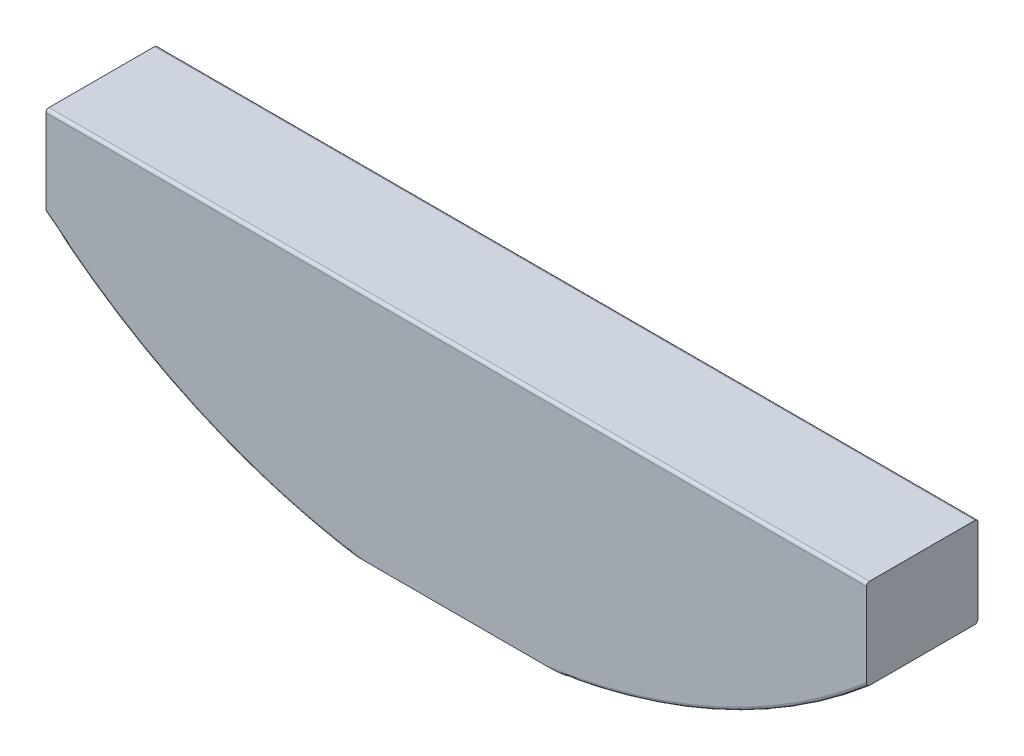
ISO-10303-21;
HEADER;
FILE_DESCRIPTION(('STEP AP214'),'2;1');
FILE_NAME('part.step','',(''),(''),'','','');
FILE_SCHEMA(('AUTOMOTIVE_DESIGN { 1 0 10303 214 1 1 1 1 }'));
ENDSEC;
DATA;
#1=APPLICATION_CONTEXT('core data for automotive mechanical design processes');
#2=APPLICATION_PROTOCOL_DEFINITION('international standard','automotive_design',2000,#1);
#3=PRODUCT_CONTEXT('',#1,'mechanical');
#4=PRODUCT('Part','Part','',(#3));
#5=PRODUCT_RELATED_PRODUCT_CATEGORY('part','',(#4));
#6=PRODUCT_DEFINITION_FORMATION('','',#4);
#7=PRODUCT_DEFINITION_CONTEXT('part definition',#1,'design');
#8=PRODUCT_DEFINITION('design','',#6,#7);
#9=PRODUCT_DEFINITION_SHAPE('','',#8);
#10=(LENGTH_UNIT() NAMED_UNIT(*) SI_UNIT(.MILLI.,.METRE.));
#11=(NAMED_UNIT(*) PLANE_ANGLE_UNIT() SI_UNIT($,.RADIAN.));
#12=(NAMED_UNIT(*) SI_UNIT($,.STERADIAN.) SOLID_ANGLE_UNIT());
#13=UNCERTAINTY_MEASURE_WITH_UNIT(LENGTH_MEASURE(1.E-05),#10,'distance_accuracy_value','');
#14=(GEOMETRIC_REPRESENTATION_CONTEXT(3) GLOBAL_UNCERTAINTY_ASSIGNED_CONTEXT((#13)) GLOBAL_UNIT_ASSIGNED_CONTEXT((#10,
#11,#12)) REPRESENTATION_CONTEXT('',''));
#15=CARTESIAN_POINT('',(0.,0.,0.));
#16=DIRECTION('',(0.,0.,1.));
#17=DIRECTION('',(1.,0.,0.));
#18=AXIS2_PLACEMENT_3D('',#15,#16,#17);
#19=CARTESIAN_POINT('',(0.,0.,4.7625));
#20=DIRECTION('',(0.,0.,-1.));
#21=DIRECTION('',(-1.,0.,0.));
#22=AXIS2_PLACEMENT_3D('',#19,#20,#21);
#23=CYLINDRICAL_SURFACE('',#22,26.9875);
#24=DIRECTION('',(0.,0.,-1.));
#25=VECTOR('',#24,1.);
#26=CARTESIAN_POINT('',(17.526,-20.5222922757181,4.7625));
#27=LINE('',#26,#25);
#28=CARTESIAN_POINT('',(17.526,-20.5222922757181,4.6355));
#29=VERTEX_POINT('',#28);
#30=CARTESIAN_POINT('',(17.526,-20.522292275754,0.127000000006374));
#31=VERTEX_POINT('',#30);
#32=EDGE_CURVE('E271',#29,#31,#27,.T.);
#33=ORIENTED_EDGE('',*,*,#32,.F.);
#34=CARTESIAN_POINT('',(0.,0.,4.6355));
#35=DIRECTION('',(0.,0.,1.));
#36=DIRECTION('',(1.,0.,0.));
#37=AXIS2_PLACEMENT_3D('',#34,#35,#36);
#38=CIRCLE('',#37,26.9875);
#39=CARTESIAN_POINT('',(4.70189522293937,-26.57475,4.6355));
#40=VERTEX_POINT('',#39);
#41=EDGE_CURVE('E153',#29,#40,#38,.F.);
#42=ORIENTED_EDGE('',*,*,#41,.T.);
#43=DIRECTION('',(0.,0.,-1.));
#44=VECTOR('',#43,1.);
#45=CARTESIAN_POINT('',(4.70189522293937,-26.57475,4.7625));
#46=LINE('',#45,#44);
#47=CARTESIAN_POINT('',(4.70189522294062,-26.57475,0.126999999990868));
#48=VERTEX_POINT('',#47);
#49=EDGE_CURVE('E142',#48,#40,#46,.F.);
#50=ORIENTED_EDGE('',*,*,#49,.F.);
#51=CARTESIAN_POINT('',(0.,0.,0.127));
#52=DIRECTION('',(0.,0.,1.));
#53=DIRECTION('',(1.,0.,0.));
#54=AXIS2_PLACEMENT_3D('',#51,#52,#53);
#55=CIRCLE('',#54,26.9875);
#56=EDGE_CURVE('E139',#48,#31,#55,.T.);
#57=ORIENTED_EDGE('',*,*,#56,.T.);
#58=EDGE_LOOP('',(#33,#42,#50,#57));
#59=FACE_BOUND('',#58,.T.);
#60=ADVANCED_FACE('F33',(#59),#23,.T.);
#61=CARTESIAN_POINT('',(0.,0.,4.7625));
#62=DIRECTION('',(0.,0.,1.));
#63=DIRECTION('',(1.,0.,0.));
#64=AXIS2_PLACEMENT_3D('',#61,#62,#63);
#65=PLANE('',#64);
#66=CARTESIAN_POINT('',(0.,0.,4.7625));
#67=DIRECTION('',(0.,0.,1.));
#68=DIRECTION('',(1.,0.,0.));
#69=AXIS2_PLACEMENT_3D('',#66,#67,#68);
#70=CIRCLE('',#69,26.8605);
#71=CARTESIAN_POINT('',(3.90757248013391,-26.57475,4.7625));
#72=VERTEX_POINT('',#71);
#73=CARTESIAN_POINT('',(17.526,-20.3549940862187,4.7625));
#74=VERTEX_POINT('',#73);
#75=EDGE_CURVE('E155',#72,#74,#70,.T.);
#76=ORIENTED_EDGE('',*,*,#75,.T.);
#77=DIRECTION('',(0.,1.,0.));
#78=VECTOR('',#77,1.);
#79=CARTESIAN_POINT('',(17.526,0.,4.7625));
#80=LINE('',#79,#78);
#81=CARTESIAN_POINT('',(17.526,-16.79575,4.7625));
#82=VERTEX_POINT('',#81);
#83=EDGE_CURVE('E222',#74,#82,#80,.T.);
#84=ORIENTED_EDGE('',*,*,#83,.T.);
#85=DIRECTION('',(-1.,0.,0.));
#86=VECTOR('',#85,1.);
#87=CARTESIAN_POINT('',(-21.2244653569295,-16.79575,4.7625));
#88=LINE('',#87,#86);
#89=CARTESIAN_POINT('',(-17.526,-16.79575,4.7625));
#90=VERTEX_POINT('',#89);
#91=EDGE_CURVE('E158',#82,#90,#88,.T.);
#92=ORIENTED_EDGE('',*,*,#91,.T.);
#93=DIRECTION('',(0.,1.,0.));
#94=VECTOR('',#93,1.);
#95=CARTESIAN_POINT('',(-17.526,0.,4.7625));
#96=LINE('',#95,#94);
#97=CARTESIAN_POINT('',(-17.526,-20.3549940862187,4.7625));
#98=VERTEX_POINT('',#97);
#99=EDGE_CURVE('E56',#98,#90,#96,.T.);
#100=ORIENTED_EDGE('',*,*,#99,.F.);
#101=CARTESIAN_POINT('',(-3.90757248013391,-26.57475,4.7625));
#102=VERTEX_POINT('',#101);
#103=EDGE_CURVE('E156',#98,#102,#70,.T.);
#104=ORIENTED_EDGE('',*,*,#103,.T.);
#105=DIRECTION('',(1.,0.,0.));
#106=VECTOR('',#105,1.);
#107=CARTESIAN_POINT('',(0.,-26.57475,4.7625));
#108=LINE('',#107,#106);
#109=EDGE_CURVE('E203',#102,#72,#108,.T.);
#110=ORIENTED_EDGE('',*,*,#109,.T.);
#111=EDGE_LOOP('',(#76,#84,#92,#100,#104,#110));
#112=FACE_BOUND('',#111,.T.);
#113=ADVANCED_FACE('F190',(#112),#65,.T.);
#114=CARTESIAN_POINT('',(0.,0.,0.));
#115=DIRECTION('',(0.,0.,1.));
#116=DIRECTION('',(1.,0.,0.));
#117=AXIS2_PLACEMENT_3D('',#114,#115,#116);
#118=PLANE('',#117);
#119=DIRECTION('',(0.,1.,0.));
#120=VECTOR('',#119,1.);
#121=CARTESIAN_POINT('',(17.526,0.,0.));
#122=LINE('',#121,#120);
#123=CARTESIAN_POINT('',(17.526,-20.3549940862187,0.));
#124=VERTEX_POINT('',#123);
#125=CARTESIAN_POINT('',(17.526,-16.79575,0.));
#126=VERTEX_POINT('',#125);
#127=EDGE_CURVE('E49',#124,#126,#122,.T.);
#128=ORIENTED_EDGE('',*,*,#127,.F.);
#129=CARTESIAN_POINT('',(0.,0.,0.));
#130=DIRECTION('',(0.,0.,1.));
#131=DIRECTION('',(1.,0.,0.));
#132=AXIS2_PLACEMENT_3D('',#129,#130,#131);
#133=CIRCLE('',#132,26.8605);
#134=CARTESIAN_POINT('',(3.90757248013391,-26.57475,0.));
#135=VERTEX_POINT('',#134);
#136=EDGE_CURVE('E161',#124,#135,#133,.F.);
#137=ORIENTED_EDGE('',*,*,#136,.T.);
#138=DIRECTION('',(1.,0.,0.));
#139=VECTOR('',#138,1.);
#140=CARTESIAN_POINT('',(0.,-26.57475,0.));
#141=LINE('',#140,#139);
#142=CARTESIAN_POINT('',(-3.90757248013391,-26.57475,0.));
#143=VERTEX_POINT('',#142);
#144=EDGE_CURVE('E242',#143,#135,#141,.T.);
#145=ORIENTED_EDGE('',*,*,#144,.F.);
#146=CARTESIAN_POINT('',(-17.526,-20.3549940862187,0.));
#147=VERTEX_POINT('',#146);
#148=EDGE_CURVE('E160',#143,#147,#133,.F.);
#149=ORIENTED_EDGE('',*,*,#148,.T.);
#150=DIRECTION('',(0.,1.,0.));
#151=VECTOR('',#150,1.);
#152=CARTESIAN_POINT('',(-17.526,0.,0.));
#153=LINE('',#152,#151);
#154=CARTESIAN_POINT('',(-17.526,-16.79575,0.));
#155=VERTEX_POINT('',#154);
#156=EDGE_CURVE('E256',#147,#155,#153,.T.);
#157=ORIENTED_EDGE('',*,*,#156,.T.);
#158=DIRECTION('',(-1.,0.,0.));
#159=VECTOR('',#158,1.);
#160=CARTESIAN_POINT('',(0.,-16.79575,0.));
#161=LINE('',#160,#159);
#162=EDGE_CURVE('E163',#155,#126,#161,.F.);
#163=ORIENTED_EDGE('',*,*,#162,.T.);
#164=EDGE_LOOP('',(#128,#137,#145,#149,#157,#163));
#165=FACE_BOUND('',#164,.T.);
#166=ADVANCED_FACE('F255',(#165),#118,.F.);
#167=CARTESIAN_POINT('',(0.,0.,4.6355));
#168=DIRECTION('',(0.,0.,1.));
#169=DIRECTION('',(1.,0.,0.));
#170=AXIS2_PLACEMENT_3D('',#167,#168,#169);
#171=TOROIDAL_SURFACE('',#170,26.8605,0.127);
#172=ORIENTED_EDGE('',*,*,#41,.F.);
#173=CARTESIAN_POINT('',(17.526,-20.5206005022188,4.65353072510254));
#174=CARTESIAN_POINT('',(17.526,-20.519418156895,4.65979938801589));
#175=CARTESIAN_POINT('',(17.526,-20.5176243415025,4.66595162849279));
#176=CARTESIAN_POINT('',(17.526,-20.5129538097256,4.67782806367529));
#177=CARTESIAN_POINT('',(17.526,-20.5100763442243,4.68355195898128));
#178=CARTESIAN_POINT('',(17.526,-20.5034473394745,4.69440243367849));
#179=CARTESIAN_POINT('',(17.526,-20.4997025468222,4.6995331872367));
#180=CARTESIAN_POINT('',(17.526,-20.4915055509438,4.70918817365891));
#181=CARTESIAN_POINT('',(17.526,-20.4870531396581,4.71371222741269));
#182=CARTESIAN_POINT('',(17.526,-20.475553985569,4.72395375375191));
#183=CARTESIAN_POINT('',(17.526,-20.468216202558,4.72934512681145));
#184=CARTESIAN_POINT('',(17.526,-20.4527641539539,4.73887223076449));
#185=CARTESIAN_POINT('',(17.526,-20.4446483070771,4.74300533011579));
#186=CARTESIAN_POINT('',(17.526,-20.4257099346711,4.75098702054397));
#187=CARTESIAN_POINT('',(17.526,-20.4147359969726,4.75447635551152));
#188=CARTESIAN_POINT('',(17.526,-20.3923711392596,4.75961614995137));
#189=CARTESIAN_POINT('',(17.526,-20.3809799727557,4.76126550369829));
#190=CARTESIAN_POINT('',(17.526,-20.3579640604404,4.76278463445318));
#191=CARTESIAN_POINT('',(17.526,-20.3463381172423,4.76263606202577));
#192=CARTESIAN_POINT('',(17.526,-20.3232528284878,4.76051315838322));
#193=CARTESIAN_POINT('',(17.526,-20.3117934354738,4.75853935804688));
#194=CARTESIAN_POINT('',(17.526,-20.2907344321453,4.75307067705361));
#195=CARTESIAN_POINT('',(17.526,-20.2810788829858,4.74979158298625));
#196=CARTESIAN_POINT('',(17.526,-20.2624184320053,4.74172042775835));
#197=CARTESIAN_POINT('',(17.526,-20.2534127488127,4.73693022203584));
#198=CARTESIAN_POINT('',(17.526,-20.2384902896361,4.72712388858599));
#199=CARTESIAN_POINT('',(17.526,-20.23235341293,4.72244297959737));
#200=CARTESIAN_POINT('',(17.526,-20.2209013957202,4.71216274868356));
#201=CARTESIAN_POINT('',(17.526,-20.2155851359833,4.70656469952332));
#202=CARTESIAN_POINT('',(17.526,-20.206973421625,4.69565033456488));
#203=CARTESIAN_POINT('',(17.526,-20.2034859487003,4.69048607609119));
#204=CARTESIAN_POINT('',(17.526,-20.1974059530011,4.67965137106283));
#205=CARTESIAN_POINT('',(17.526,-20.1948129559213,4.67398119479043));
#206=CARTESIAN_POINT('',(17.526,-20.1906743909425,4.6622202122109));
#207=CARTESIAN_POINT('',(17.526,-20.1891363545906,4.65612671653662));
#208=CARTESIAN_POINT('',(17.526,-20.187262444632,4.64375759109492));
#209=CARTESIAN_POINT('',(17.526,-20.1869258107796,4.63748207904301));
#210=CARTESIAN_POINT('',(17.526,-20.1874479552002,4.62572637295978));
#211=CARTESIAN_POINT('',(17.526,-20.1881705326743,4.62023960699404));
#212=CARTESIAN_POINT('',(17.526,-20.190521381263,4.60946541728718));
#213=CARTESIAN_POINT('',(17.526,-20.1921496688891,4.60417799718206));
#214=CARTESIAN_POINT('',(17.526,-20.1962315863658,4.59388705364));
#215=CARTESIAN_POINT('',(17.526,-20.1986916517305,4.58888611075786));
#216=CARTESIAN_POINT('',(17.526,-20.2043111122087,4.5792964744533));
#217=CARTESIAN_POINT('',(17.526,-20.207470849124,4.57470798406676));
#218=CARTESIAN_POINT('',(17.526,-20.2158220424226,4.5641514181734));
#219=CARTESIAN_POINT('',(17.526,-20.2213087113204,4.55841622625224));
#220=CARTESIAN_POINT('',(17.526,-20.2331413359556,4.54791127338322));
#221=CARTESIAN_POINT('',(17.526,-20.2394890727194,4.54314356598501));
#222=CARTESIAN_POINT('',(17.526,-20.2548029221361,4.53327307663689));
#223=CARTESIAN_POINT('',(17.526,-20.2639820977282,4.52850130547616));
#224=CARTESIAN_POINT('',(17.526,-20.2829828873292,4.52050763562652));
#225=CARTESIAN_POINT('',(17.526,-20.2928049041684,4.51728671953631));
#226=CARTESIAN_POINT('',(17.526,-20.3129864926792,4.51228415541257));
#227=CARTESIAN_POINT('',(17.526,-20.3233524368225,4.51052846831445));
#228=CARTESIAN_POINT('',(17.526,-20.3442304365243,4.50851160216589));
#229=CARTESIAN_POINT('',(17.526,-20.3547425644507,4.50825119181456));
#230=CARTESIAN_POINT('',(17.526,-20.3774504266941,4.5093034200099));
#231=CARTESIAN_POINT('',(17.526,-20.3896346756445,4.51088554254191));
#232=CARTESIAN_POINT('',(17.526,-20.4135499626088,4.51614047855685));
#233=CARTESIAN_POINT('',(17.526,-20.4252813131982,4.51981182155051));
#234=CARTESIAN_POINT('',(17.526,-20.4447310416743,4.52804487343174));
#235=CARTESIAN_POINT('',(17.526,-20.4526695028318,4.53208852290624));
#236=CARTESIAN_POINT('',(17.526,-20.4678059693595,4.54138352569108));
#237=CARTESIAN_POINT('',(17.526,-20.4750051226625,4.54663296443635));
#238=CARTESIAN_POINT('',(17.526,-20.4868903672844,4.55708989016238));
#239=CARTESIAN_POINT('',(17.526,-20.4917834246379,4.562061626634));
#240=CARTESIAN_POINT('',(17.526,-20.5007020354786,4.57273323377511));
#241=CARTESIAN_POINT('',(17.526,-20.5047285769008,4.57843226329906));
#242=CARTESIAN_POINT('',(17.526,-20.511125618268,4.58951012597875));
#243=CARTESIAN_POINT('',(17.526,-20.5136577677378,4.59479525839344));
#244=CARTESIAN_POINT('',(17.526,-20.517805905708,4.60571544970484));
#245=CARTESIAN_POINT('',(17.526,-20.5194223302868,4.6113503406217));
#246=CARTESIAN_POINT('',(17.526,-20.5216831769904,4.62308457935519));
#247=CARTESIAN_POINT('',(17.526,-20.5222795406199,4.62919337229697));
#248=CARTESIAN_POINT('',(17.526,-20.522304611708,4.64141396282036));
#249=CARTESIAN_POINT('',(17.526,-20.5217331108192,4.64752576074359));
#250=CARTESIAN_POINT('',(17.526,-20.5206005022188,4.65353072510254));
#251=B_SPLINE_CURVE_WITH_KNOTS('',3,(#173,#174,#175,#176,#177,#178,#179,#180,#181,#182,#183,
#184,#185,#186,#187,#188,#189,#190,#191,#192,#193,#194,#195,#196,#197,#198,#199,#200,#201,#202,
#203,#204,#205,#206,#207,#208,#209,#210,#211,#212,#213,#214,#215,#216,#217,#218,#219,#220,#221,
#222,#223,#224,#225,#226,#227,#228,#229,#230,#231,#232,#233,#234,#235,#236,#237,#238,#239,#240,
#241,#242,#243,#244,#245,#246,#247,#248,#249,#250),.UNSPECIFIED.,.T.,.F.,(4,2,2,2,2,2,2,2,2,2,2,
2,2,2,2,2,2,2,2,2,2,2,2,2,2,2,2,2,2,2,2,2,2,2,2,2,2,2,4),(0.,0.0191098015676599,
0.0382328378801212,0.0572118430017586,0.0761964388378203,0.103363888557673,0.130587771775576,
0.164955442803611,0.199343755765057,0.234083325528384,0.268812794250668,0.299290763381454,
0.329731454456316,0.352805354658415,0.375847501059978,0.394468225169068,0.413079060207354,
0.431821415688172,0.450551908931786,0.46707506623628,0.483598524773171,0.500252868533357,
0.516915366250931,0.540595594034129,0.56432557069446,0.595197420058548,0.626088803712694,
0.657516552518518,0.688960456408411,0.725646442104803,0.762306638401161,0.788941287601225,
0.815533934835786,0.836383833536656,0.857209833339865,0.874717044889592,0.892215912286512,
0.910518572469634,0.928824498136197),.UNSPECIFIED.);
#252=EDGE_CURVE('E220',#29,#74,#251,.T.);
#253=ORIENTED_EDGE('',*,*,#252,.T.);
#254=ORIENTED_EDGE('',*,*,#75,.F.);
#255=CARTESIAN_POINT('',(3.96450830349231,-26.57475,4.50877426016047));
#256=CARTESIAN_POINT('',(3.92213971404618,-26.57475,4.50836279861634));
#257=CARTESIAN_POINT('',(3.87976687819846,-26.57475,4.50841971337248));
#258=CARTESIAN_POINT('',(3.79508131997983,-26.57475,4.50938722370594));
#259=CARTESIAN_POINT('',(3.75276858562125,-26.57475,4.51029681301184));
#260=CARTESIAN_POINT('',(3.66821705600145,-26.57475,4.51293615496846));
#261=CARTESIAN_POINT('',(3.62597823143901,-26.57475,4.51466497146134));
#262=CARTESIAN_POINT('',(3.54153042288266,-26.57475,4.51896192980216));
#263=CARTESIAN_POINT('',(3.49932145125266,-26.57475,4.52153031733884));
#264=CARTESIAN_POINT('',(3.41473750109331,-26.57475,4.5276111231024));
#265=CARTESIAN_POINT('',(3.37236288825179,-26.57475,4.53112866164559));
#266=CARTESIAN_POINT('',(3.28775754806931,-26.57475,4.53929606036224));
#267=CARTESIAN_POINT('',(3.24552672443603,-26.57475,4.54394487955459));
#268=CARTESIAN_POINT('',(3.18223338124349,-26.57475,4.55216407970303));
#269=CARTESIAN_POINT('',(3.16109217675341,-26.57475,4.55512034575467));
#270=CARTESIAN_POINT('',(3.11884968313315,-26.57475,4.56160312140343));
#271=CARTESIAN_POINT('',(3.09774858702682,-26.57475,4.56513088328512));
#272=CARTESIAN_POINT('',(3.05587649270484,-26.57475,4.57296430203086));
#273=CARTESIAN_POINT('',(3.03510423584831,-26.57475,4.57726262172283));
#274=CARTESIAN_POINT('',(3.00425469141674,-26.57475,4.58481039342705));
#275=CARTESIAN_POINT('',(2.99404021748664,-26.57475,4.58750414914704));
#276=CARTESIAN_POINT('',(2.97377899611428,-26.57475,4.59345541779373));
#277=CARTESIAN_POINT('',(2.96373196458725,-26.57475,4.59671183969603));
#278=CARTESIAN_POINT('',(2.94780282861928,-26.57475,4.60286372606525));
#279=CARTESIAN_POINT('',(2.94178699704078,-26.57475,4.60542725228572));
#280=CARTESIAN_POINT('',(2.9300351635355,-26.57475,4.61128952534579));
#281=CARTESIAN_POINT('',(2.92429941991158,-26.57475,4.61458893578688));
#282=CARTESIAN_POINT('',(2.91826078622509,-26.57475,4.61956227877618));
#283=CARTESIAN_POINT('',(2.91730243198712,-26.57475,4.62040557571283));
#284=CARTESIAN_POINT('',(2.91546776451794,-26.57475,4.62218179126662));
#285=CARTESIAN_POINT('',(2.9145916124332,-26.57475,4.62311487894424));
#286=CARTESIAN_POINT('',(2.91295126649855,-26.57475,4.6250987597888));
#287=CARTESIAN_POINT('',(2.91218876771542,-26.57475,4.62615098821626));
#288=CARTESIAN_POINT('',(2.91086306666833,-26.57475,4.62837425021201));
#289=CARTESIAN_POINT('',(2.91029897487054,-26.57475,4.62954472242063));
#290=CARTESIAN_POINT('',(2.90961763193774,-26.57475,4.6315325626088));
#291=CARTESIAN_POINT('',(2.90941222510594,-26.57475,4.63231945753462));
#292=CARTESIAN_POINT('',(2.90913711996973,-26.57475,4.63391660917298));
#293=CARTESIAN_POINT('',(2.90906727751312,-26.57475,4.63472684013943));
#294=CARTESIAN_POINT('',(2.90907159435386,-26.57475,4.63634813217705));
#295=CARTESIAN_POINT('',(2.90914597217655,-26.57475,4.63715919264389));
#296=CARTESIAN_POINT('',(2.90943009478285,-26.57475,4.63875731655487));
#297=CARTESIAN_POINT('',(2.90963998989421,-26.57475,4.63954435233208));
#298=CARTESIAN_POINT('',(2.91026659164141,-26.57475,4.64134362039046));
#299=CARTESIAN_POINT('',(2.91072974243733,-26.57475,4.64233947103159));
#300=CARTESIAN_POINT('',(2.91180580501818,-26.57475,4.64424616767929));
#301=CARTESIAN_POINT('',(2.91241908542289,-26.57475,4.64515679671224));
#302=CARTESIAN_POINT('',(2.91429059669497,-26.57475,4.64761003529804));
#303=CARTESIAN_POINT('',(2.91566653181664,-26.57475,4.64906146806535));
#304=CARTESIAN_POINT('',(2.91859975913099,-26.57475,4.65176552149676));
#305=CARTESIAN_POINT('',(2.92015763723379,-26.57475,4.65301746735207));
#306=CARTESIAN_POINT('',(2.9271784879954,-26.57475,4.65818873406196));
#307=CARTESIAN_POINT('',(2.93314640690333,-26.57475,4.6613979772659));
#308=CARTESIAN_POINT('',(2.94538866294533,-26.57475,4.66715314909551));
#309=CARTESIAN_POINT('',(2.95166486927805,-26.57475,4.66969422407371));
#310=CARTESIAN_POINT('',(2.97301874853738,-26.57475,4.67758565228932));
#311=CARTESIAN_POINT('',(2.98842982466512,-26.57475,4.68204270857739));
#312=CARTESIAN_POINT('',(3.01948959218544,-26.57475,4.69004929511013));
#313=CARTESIAN_POINT('',(3.03513881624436,-26.57475,4.69359632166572));
#314=CARTESIAN_POINT('',(3.06655427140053,-26.57475,4.70009612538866));
#315=CARTESIAN_POINT('',(3.08232041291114,-26.57475,4.70304931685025));
#316=CARTESIAN_POINT('',(3.11389857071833,-26.57475,4.70854763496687));
#317=CARTESIAN_POINT('',(3.12971049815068,-26.57475,4.71109329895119));
#318=CARTESIAN_POINT('',(3.17778583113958,-26.57475,4.71836089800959));
#319=CARTESIAN_POINT('',(3.21012177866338,-26.57475,4.72260513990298));
#320=CARTESIAN_POINT('',(3.27489455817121,-26.57475,4.73024837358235));
#321=CARTESIAN_POINT('',(3.30733140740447,-26.57475,4.73364721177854));
#322=CARTESIAN_POINT('',(3.40479973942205,-26.57475,4.74286623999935));
#323=CARTESIAN_POINT('',(3.46992513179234,-26.57475,4.74770028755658));
#324=CARTESIAN_POINT('',(3.60022855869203,-26.57475,4.7553396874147));
#325=CARTESIAN_POINT('',(3.66540649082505,-26.57475,4.7581468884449));
#326=CARTESIAN_POINT('',(3.79578306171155,-26.57475,4.76181275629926));
#327=CARTESIAN_POINT('',(3.86098167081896,-26.57475,4.76267246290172));
#328=CARTESIAN_POINT('',(3.99117948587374,-26.57475,4.76227017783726));
#329=CARTESIAN_POINT('',(4.05617869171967,-26.57475,4.76101466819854));
#330=CARTESIAN_POINT('',(4.15360680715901,-26.57475,4.7571361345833));
#331=CARTESIAN_POINT('',(4.18607605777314,-26.57475,4.7555103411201));
#332=CARTESIAN_POINT('',(4.25095464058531,-26.57475,4.75146089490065));
#333=CARTESIAN_POINT('',(4.28336399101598,-26.57475,4.74903754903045));
#334=CARTESIAN_POINT('',(4.34208584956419,-26.57475,4.74372549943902));
#335=CARTESIAN_POINT('',(4.3684137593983,-26.57475,4.74100658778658));
#336=CARTESIAN_POINT('',(4.42100422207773,-26.57475,4.73470896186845));
#337=CARTESIAN_POINT('',(4.44726666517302,-26.57475,4.73112926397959));
#338=CARTESIAN_POINT('',(4.49743061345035,-26.57475,4.72309699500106));
#339=CARTESIAN_POINT('',(4.52134816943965,-26.57475,4.71874078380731));
#340=CARTESIAN_POINT('',(4.56885134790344,-26.57475,4.70851663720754));
#341=CARTESIAN_POINT('',(4.59243768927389,-26.57475,4.70265279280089));
#342=CARTESIAN_POINT('',(4.62720608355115,-26.57475,4.69144918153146));
#343=CARTESIAN_POINT('',(4.63877692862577,-26.57475,4.68727328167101));
#344=CARTESIAN_POINT('',(4.66130434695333,-26.57475,4.67757093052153));
#345=CARTESIAN_POINT('',(4.67226704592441,-26.57475,4.67206319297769));
#346=CARTESIAN_POINT('',(4.68379279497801,-26.57475,4.66362696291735));
#347=CARTESIAN_POINT('',(4.68548484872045,-26.57475,4.66231016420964));
#348=CARTESIAN_POINT('',(4.68875453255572,-26.57475,4.65953315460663));
#349=CARTESIAN_POINT('',(4.69033191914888,-26.57475,4.6580726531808));
#350=CARTESIAN_POINT('',(4.69333047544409,-26.57475,4.65496706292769));
#351=CARTESIAN_POINT('',(4.6947498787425,-26.57475,4.65332023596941));
#352=CARTESIAN_POINT('',(4.69731278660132,-26.57475,4.64982295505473));
#353=CARTESIAN_POINT('',(4.69845717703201,-26.57475,4.64797318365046));
#354=CARTESIAN_POINT('',(4.69997003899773,-26.57475,4.64480352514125));
#355=CARTESIAN_POINT('',(4.70046842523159,-26.57475,4.64354633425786));
#356=CARTESIAN_POINT('',(4.701256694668,-26.57475,4.6409683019));
#357=CARTESIAN_POINT('',(4.70154688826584,-26.57475,4.63964755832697));
#358=CARTESIAN_POINT('',(4.70188747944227,-26.57475,4.6369658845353));
#359=CARTESIAN_POINT('',(4.7019363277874,-26.57475,4.63560475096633));
#360=CARTESIAN_POINT('',(4.70178356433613,-26.57475,4.63289639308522));
#361=CARTESIAN_POINT('',(4.70158180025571,-26.57475,4.63154917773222));
#362=CARTESIAN_POINT('',(4.70090865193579,-26.57475,4.62872546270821));
#363=CARTESIAN_POINT('',(4.70040356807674,-26.57475,4.62725716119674));
#364=CARTESIAN_POINT('',(4.6991622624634,-26.57475,4.62442233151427));
#365=CARTESIAN_POINT('',(4.69842560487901,-26.57475,4.62305600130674));
#366=CARTESIAN_POINT('',(4.6962728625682,-26.57475,4.61961547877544));
#367=CARTESIAN_POINT('',(4.69471896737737,-26.57475,4.6176287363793));
#368=CARTESIAN_POINT('',(4.6913439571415,-26.57475,4.61389924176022));
#369=CARTESIAN_POINT('',(4.68952206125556,-26.57475,4.61215723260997));
#370=CARTESIAN_POINT('',(4.68221665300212,-26.57475,4.60582089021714));
#371=CARTESIAN_POINT('',(4.67617435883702,-26.57475,4.6018881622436));
#372=CARTESIAN_POINT('',(4.66364379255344,-26.57475,4.59481611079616));
#373=CARTESIAN_POINT('',(4.65715262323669,-26.57475,4.59168270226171));
#374=CARTESIAN_POINT('',(4.63732485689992,-26.57475,4.58302318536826));
#375=CARTESIAN_POINT('',(4.62365830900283,-26.57475,4.57825311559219));
#376=CARTESIAN_POINT('',(4.59600427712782,-26.57475,4.56973460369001));
#377=CARTESIAN_POINT('',(4.58201597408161,-26.57475,4.56598917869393));
#378=CARTESIAN_POINT('',(4.55385745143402,-26.57475,4.55918377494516));
#379=CARTESIAN_POINT('',(4.53968707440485,-26.57475,4.55612443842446));
#380=CARTESIAN_POINT('',(4.51127154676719,-26.57475,4.55050800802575));
#381=CARTESIAN_POINT('',(4.49702652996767,-26.57475,4.54795021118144));
#382=CARTESIAN_POINT('',(4.44000822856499,-26.57475,4.53847768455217));
#383=CARTESIAN_POINT('',(4.39699009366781,-26.57475,4.53304549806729));
#384=CARTESIAN_POINT('',(4.31072743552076,-26.57475,4.52412573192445));
#385=CARTESIAN_POINT('',(4.26748270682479,-26.57475,4.52064042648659));
#386=CARTESIAN_POINT('',(4.18095877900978,-26.57475,4.51510924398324));
#387=CARTESIAN_POINT('',(4.13767970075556,-26.57475,4.51306147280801));
#388=CARTESIAN_POINT('',(4.05110465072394,-26.57475,4.51010448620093));
#389=CARTESIAN_POINT('',(4.00780869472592,-26.57475,4.50919477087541));
#390=CARTESIAN_POINT('',(3.96450830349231,-26.57475,4.50877426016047));
#391=B_SPLINE_CURVE_WITH_KNOTS('',3,(#255,#256,#257,#258,#259,#260,#261,#262,#263,#264,#265,
#266,#267,#268,#269,#270,#271,#272,#273,#274,#275,#276,#277,#278,#279,#280,#281,#282,#283,#284,
#285,#286,#287,#288,#289,#290,#291,#292,#293,#294,#295,#296,#297,#298,#299,#300,#301,#302,#303,
#304,#305,#306,#307,#308,#309,#310,#311,#312,#313,#314,#315,#316,#317,#318,#319,#320,#321,#322,
#323,#324,#325,#326,#327,#328,#329,#330,#331,#332,#333,#334,#335,#336,#337,#338,#339,#340,#341,
#342,#343,#344,#345,#346,#347,#348,#349,#350,#351,#352,#353,#354,#355,#356,#357,#358,#359,#360,
#361,#362,#363,#364,#365,#366,#367,#368,#369,#370,#371,#372,#373,#374,#375,#376,#377,#378,#379,
#380,#381,#382,#383,#384,#385,#386,#387,#388,#389,#390),.UNSPECIFIED.,.T.,.F.,(4,2,2,2,2,2,2,2,
2,2,2,2,2,2,2,2,2,2,2,2,2,2,2,2,2,2,2,2,2,2,2,2,2,2,2,2,2,2,2,2,2,2,2,2,2,2,2,2,2,2,2,2,2,2,2,2,
2,2,2,2,2,2,2,2,2,2,2,4),(0.,0.127109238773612,0.254068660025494,0.380883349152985,
0.507735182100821,0.635285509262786,0.762718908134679,0.826753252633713,0.89092985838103,
0.954525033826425,0.986214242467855,1.01784268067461,1.03746916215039,1.05711341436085,
1.06093847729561,1.06477088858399,1.06865571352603,1.07252289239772,1.07495257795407,
1.07737967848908,1.07981045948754,1.08224394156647,1.08552000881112,1.08880420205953,
1.09477031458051,1.10075619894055,1.12092808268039,1.14124268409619,1.1892540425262,
1.23739610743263,1.28550446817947,1.33354886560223,1.43136817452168,1.52920524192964,
1.72507259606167,1.92076106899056,2.11634503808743,2.3113307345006,2.40885362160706,
2.50633902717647,2.5857351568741,2.66522244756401,2.73815293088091,2.81088756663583,
2.84780506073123,2.884231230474,2.8906569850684,2.89709600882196,2.90360101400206,
2.91008477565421,2.91412748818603,2.91816416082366,2.92222671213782,2.92629173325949,
2.93092409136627,2.93556522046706,2.94308905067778,2.95063525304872,2.97209216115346,
2.99370352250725,3.03701148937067,3.08044563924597,3.12392027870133,3.16733354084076,
3.29731563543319,3.42744925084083,3.55741107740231,3.68731579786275),.UNSPECIFIED.);
#392=EDGE_CURVE('E137',#72,#40,#391,.T.);
#393=ORIENTED_EDGE('',*,*,#392,.T.);
#394=EDGE_LOOP('',(#172,#253,#254,#393));
#395=FACE_BOUND('',#394,.T.);
#396=ADVANCED_FACE('F35',(#395),#171,.T.);
#397=CARTESIAN_POINT('',(0.,0.,0.127));
#398=DIRECTION('',(0.,0.,1.));
#399=DIRECTION('',(1.,0.,0.));
#400=AXIS2_PLACEMENT_3D('',#397,#398,#399);
#401=TOROIDAL_SURFACE('',#400,26.8605,0.127);
#402=ORIENTED_EDGE('',*,*,#136,.F.);
#403=CARTESIAN_POINT('',(17.526,-20.5206005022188,0.108969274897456));
#404=CARTESIAN_POINT('',(17.526,-20.5216469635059,0.114515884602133));
#405=CARTESIAN_POINT('',(17.526,-20.5222145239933,0.120152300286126));
#406=CARTESIAN_POINT('',(17.526,-20.5223549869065,0.131437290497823));
#407=CARTESIAN_POINT('',(17.526,-20.5219281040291,0.137085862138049));
#408=CARTESIAN_POINT('',(17.526,-20.520110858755,0.148212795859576));
#409=CARTESIAN_POINT('',(17.526,-20.5187222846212,0.153691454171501));
#410=CARTESIAN_POINT('',(17.526,-20.5150712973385,0.164347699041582));
#411=CARTESIAN_POINT('',(17.526,-20.5128085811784,0.169525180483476));
#412=CARTESIAN_POINT('',(17.526,-20.5074514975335,0.179624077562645));
#413=CARTESIAN_POINT('',(17.526,-20.5043345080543,0.18453338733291));
#414=CARTESIAN_POINT('',(17.526,-20.4974414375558,0.193861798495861));
#415=CARTESIAN_POINT('',(17.526,-20.4936650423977,0.198280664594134));
#416=CARTESIAN_POINT('',(17.526,-20.4836625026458,0.208573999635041));
#417=CARTESIAN_POINT('',(17.526,-20.4771236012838,0.214145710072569));
#418=CARTESIAN_POINT('',(17.526,-20.4632279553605,0.224158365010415));
#419=CARTESIAN_POINT('',(17.526,-20.4558694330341,0.228596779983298));
#420=CARTESIAN_POINT('',(17.526,-20.4384377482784,0.237470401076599));
#421=CARTESIAN_POINT('',(17.526,-20.4281843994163,0.24155145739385));
#422=CARTESIAN_POINT('',(17.526,-20.4071601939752,0.247990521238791));
#423=CARTESIAN_POINT('',(17.526,-20.3963891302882,0.250347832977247));
#424=CARTESIAN_POINT('',(17.526,-20.3744731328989,0.253425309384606));
#425=CARTESIAN_POINT('',(17.526,-20.3633251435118,0.254123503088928));
#426=CARTESIAN_POINT('',(17.526,-20.3410413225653,0.253840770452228));
#427=CARTESIAN_POINT('',(17.526,-20.3299055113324,0.252858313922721));
#428=CARTESIAN_POINT('',(17.526,-20.3066902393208,0.248984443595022));
#429=CARTESIAN_POINT('',(17.526,-20.2946432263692,0.245893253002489));
#430=CARTESIAN_POINT('',(17.526,-20.2713393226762,0.237508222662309));
#431=CARTESIAN_POINT('',(17.526,-20.2600808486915,0.232218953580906));
#432=CARTESIAN_POINT('',(17.526,-20.2428486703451,0.221688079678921));
#433=CARTESIAN_POINT('',(17.526,-20.2364496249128,0.217138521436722));
#434=CARTESIAN_POINT('',(17.526,-20.2244464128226,0.207089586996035));
#435=CARTESIAN_POINT('',(17.526,-20.2188409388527,0.201591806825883));
#436=CARTESIAN_POINT('',(17.526,-20.2096635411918,0.190796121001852));
#437=CARTESIAN_POINT('',(17.526,-20.2059074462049,0.185655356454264));
#438=CARTESIAN_POINT('',(17.526,-20.1992870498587,0.174823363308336));
#439=CARTESIAN_POINT('',(17.526,-20.1964223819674,0.169132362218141));
#440=CARTESIAN_POINT('',(17.526,-20.1917500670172,0.15727443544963));
#441=CARTESIAN_POINT('',(17.526,-20.1899508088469,0.151104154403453));
#442=CARTESIAN_POINT('',(17.526,-20.1875927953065,0.138531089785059));
#443=CARTESIAN_POINT('',(17.526,-20.1870330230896,0.132128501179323));
#444=CARTESIAN_POINT('',(17.526,-20.1871895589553,0.120176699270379));
#445=CARTESIAN_POINT('',(17.526,-20.1877493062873,0.1146248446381));
#446=CARTESIAN_POINT('',(17.526,-20.1898021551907,0.103698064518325));
#447=CARTESIAN_POINT('',(17.526,-20.1912952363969,0.098323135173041));
#448=CARTESIAN_POINT('',(17.526,-20.1951090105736,0.0879219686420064));
#449=CARTESIAN_POINT('',(17.526,-20.1974238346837,0.0828935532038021));
#450=CARTESIAN_POINT('',(17.526,-20.2027644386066,0.0732321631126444));
#451=CARTESIAN_POINT('',(17.526,-20.2057905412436,0.0685993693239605));
#452=CARTESIAN_POINT('',(17.526,-20.2137775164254,0.0579961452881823));
#453=CARTESIAN_POINT('',(17.526,-20.2190260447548,0.0522418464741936));
#454=CARTESIAN_POINT('',(17.526,-20.2303894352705,0.0416615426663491));
#455=CARTESIAN_POINT('',(17.526,-20.2365060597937,0.0368374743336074));
#456=CARTESIAN_POINT('',(17.526,-20.2513096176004,0.0267951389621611));
#457=CARTESIAN_POINT('',(17.526,-20.2602145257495,0.0218986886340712));
#458=CARTESIAN_POINT('',(17.526,-20.2786904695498,0.0136118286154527));
#459=CARTESIAN_POINT('',(17.526,-20.2882619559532,0.0102224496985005));
#460=CARTESIAN_POINT('',(17.526,-20.3079714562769,0.00483451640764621));
#461=CARTESIAN_POINT('',(17.526,-20.3181165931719,0.00286227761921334));
#462=CARTESIAN_POINT('',(17.526,-20.3385838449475,0.000366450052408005));
#463=CARTESIAN_POINT('',(17.526,-20.3489060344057,-0.000156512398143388));
#464=CARTESIAN_POINT('',(17.526,-20.3713784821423,0.000272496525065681));
#465=CARTESIAN_POINT('',(17.526,-20.3835243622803,0.00150600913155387));
#466=CARTESIAN_POINT('',(17.526,-20.4074356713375,0.00602357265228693));
#467=CARTESIAN_POINT('',(17.526,-20.419201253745,0.00930678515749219));
#468=CARTESIAN_POINT('',(17.526,-20.4391062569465,0.0169454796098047));
#469=CARTESIAN_POINT('',(17.526,-20.4474243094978,0.0208367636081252));
#470=CARTESIAN_POINT('',(17.526,-20.4633360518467,0.0298921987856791));
#471=CARTESIAN_POINT('',(17.526,-20.4709309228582,0.0350542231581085));
#472=CARTESIAN_POINT('',(17.526,-20.4834822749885,0.0453863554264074));
#473=CARTESIAN_POINT('',(17.526,-20.4886498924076,0.0502993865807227));
#474=CARTESIAN_POINT('',(17.526,-20.4981293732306,0.060898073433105));
#475=CARTESIAN_POINT('',(17.526,-20.502441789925,0.0665832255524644));
#476=CARTESIAN_POINT('',(17.526,-20.5096709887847,0.0781805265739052));
#477=CARTESIAN_POINT('',(17.526,-20.5126700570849,0.0840408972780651));
#478=CARTESIAN_POINT('',(17.526,-20.5175269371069,0.0962173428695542));
#479=CARTESIAN_POINT('',(17.526,-20.5193861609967,0.102532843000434));
#480=CARTESIAN_POINT('',(17.526,-20.5206005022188,0.108969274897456));
#481=B_SPLINE_CURVE_WITH_KNOTS('',3,(#403,#404,#405,#406,#407,#408,#409,#410,#411,#412,#413,
#414,#415,#416,#417,#418,#419,#420,#421,#422,#423,#424,#425,#426,#427,#428,#429,#430,#431,#432,
#433,#434,#435,#436,#437,#438,#439,#440,#441,#442,#443,#444,#445,#446,#447,#448,#449,#450,#451,
#452,#453,#454,#455,#456,#457,#458,#459,#460,#461,#462,#463,#464,#465,#466,#467,#468,#469,#470,
#471,#472,#473,#474,#475,#476,#477,#478,#479,#480),.UNSPECIFIED.,.T.,.F.,(4,2,2,2,2,2,2,2,2,2,2,
2,2,2,2,2,2,2,2,2,2,2,2,2,2,2,2,2,2,2,2,2,2,2,2,2,2,2,4),(0.,0.0169102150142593,
0.0338167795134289,0.0506919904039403,0.0675730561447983,0.0849535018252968,0.102342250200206,
0.127972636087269,0.15365973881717,0.186593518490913,0.219540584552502,0.252921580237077,
0.286332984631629,0.323452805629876,0.360495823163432,0.383971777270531,0.407408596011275,
0.426434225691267,0.445452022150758,0.464617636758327,0.48376752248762,0.500425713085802,
0.517083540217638,0.533624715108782,0.550173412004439,0.573410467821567,0.596695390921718,
0.627020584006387,0.657366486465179,0.688262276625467,0.719171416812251,0.755627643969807,
0.792068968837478,0.819522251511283,0.846929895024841,0.868242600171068,0.889541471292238,
0.909188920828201,0.928811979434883),.UNSPECIFIED.);
#482=EDGE_CURVE('E277',#124,#31,#481,.T.);
#483=ORIENTED_EDGE('',*,*,#482,.T.);
#484=ORIENTED_EDGE('',*,*,#56,.F.);
#485=CARTESIAN_POINT('',(3.96450830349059,-26.57475,0.253725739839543));
#486=CARTESIAN_POINT('',(4.00685650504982,-26.57475,0.253314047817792));
#487=CARTESIAN_POINT('',(4.04920020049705,-26.57475,0.252435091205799));
#488=CARTESIAN_POINT('',(4.13385503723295,-26.57475,0.24959308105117));
#489=CARTESIAN_POINT('',(4.17616617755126,-26.57475,0.247629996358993));
#490=CARTESIAN_POINT('',(4.26073492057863,-26.57475,0.242349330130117));
#491=CARTESIAN_POINT('',(4.30299246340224,-26.57475,0.239030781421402));
#492=CARTESIAN_POINT('',(4.38734358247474,-26.57475,0.230572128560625));
#493=CARTESIAN_POINT('',(4.42943716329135,-26.57475,0.225432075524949));
#494=CARTESIAN_POINT('',(4.49223945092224,-26.57475,0.215451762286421));
#495=CARTESIAN_POINT('',(4.51312584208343,-26.57475,0.21174459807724));
#496=CARTESIAN_POINT('',(4.55467291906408,-26.57475,0.203229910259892));
#497=CARTESIAN_POINT('',(4.57533373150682,-26.57475,0.198423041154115));
#498=CARTESIAN_POINT('',(4.60595450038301,-26.57475,0.189779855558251));
#499=CARTESIAN_POINT('',(4.61610641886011,-26.57475,0.186657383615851));
#500=CARTESIAN_POINT('',(4.63614975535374,-26.57475,0.179684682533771));
#501=CARTESIAN_POINT('',(4.64604105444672,-26.57475,0.17583412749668));
#502=CARTESIAN_POINT('',(4.66539442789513,-26.57475,0.166927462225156));
#503=CARTESIAN_POINT('',(4.6748561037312,-26.57475,0.161870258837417));
#504=CARTESIAN_POINT('',(4.68510526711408,-26.57475,0.154108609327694));
#505=CARTESIAN_POINT('',(4.68683934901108,-26.57475,0.152702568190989));
#506=CARTESIAN_POINT('',(4.69017036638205,-26.57475,0.149725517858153));
#507=CARTESIAN_POINT('',(4.69176693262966,-26.57475,0.14815408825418));
#508=CARTESIAN_POINT('',(4.69476995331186,-26.57475,0.144790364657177));
#509=CARTESIAN_POINT('',(4.69617307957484,-26.57475,0.142995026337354));
#510=CARTESIAN_POINT('',(4.69861959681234,-26.57475,0.139174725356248));
#511=CARTESIAN_POINT('',(4.69966503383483,-26.57475,0.137151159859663));
#512=CARTESIAN_POINT('',(4.70088259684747,-26.57475,0.133803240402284));
#513=CARTESIAN_POINT('',(4.70123706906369,-26.57475,0.132545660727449));
#514=CARTESIAN_POINT('',(4.70173016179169,-26.57475,0.129988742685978));
#515=CARTESIAN_POINT('',(4.70186900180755,-26.57475,0.128689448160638));
#516=CARTESIAN_POINT('',(4.7019146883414,-26.57475,0.126083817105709));
#517=CARTESIAN_POINT('',(4.70182102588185,-26.57475,0.124777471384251));
#518=CARTESIAN_POINT('',(4.70141206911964,-26.57475,0.122199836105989));
#519=CARTESIAN_POINT('',(4.70109654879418,-26.57475,0.120928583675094));
#520=CARTESIAN_POINT('',(4.70015189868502,-26.57475,0.118074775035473));
#521=CARTESIAN_POINT('',(4.69945678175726,-26.57475,0.1165143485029));
#522=CARTESIAN_POINT('',(4.69782936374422,-26.57475,0.113523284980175));
#523=CARTESIAN_POINT('',(4.69689651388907,-26.57475,0.112092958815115));
#524=CARTESIAN_POINT('',(4.69409862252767,-26.57475,0.1083231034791));
#525=CARTESIAN_POINT('',(4.69206172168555,-26.57475,0.106112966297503));
#526=CARTESIAN_POINT('',(4.6877053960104,-26.57475,0.101994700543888));
#527=CARTESIAN_POINT('',(4.68538509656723,-26.57475,0.100087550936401));
#528=CARTESIAN_POINT('',(4.6754618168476,-26.57475,0.0926462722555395));
#529=CARTESIAN_POINT('',(4.66716353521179,-26.57475,0.0880683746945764));
#530=CARTESIAN_POINT('',(4.65009488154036,-26.57475,0.0799132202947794));
#531=CARTESIAN_POINT('',(4.64132160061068,-26.57475,0.0763432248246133));
#532=CARTESIAN_POINT('',(4.61256916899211,-26.57475,0.0657826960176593));
#533=CARTESIAN_POINT('',(4.59213862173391,-26.57475,0.0600162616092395));
#534=CARTESIAN_POINT('',(4.55092055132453,-26.57475,0.0499090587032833));
#535=CARTESIAN_POINT('',(4.53013213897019,-26.57475,0.0455726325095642));
#536=CARTESIAN_POINT('',(4.4883550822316,-26.57475,0.0378559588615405));
#537=CARTESIAN_POINT('',(4.46736628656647,-26.57475,0.0344765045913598));
#538=CARTESIAN_POINT('',(4.42532652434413,-26.57475,0.0284075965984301));
#539=CARTESIAN_POINT('',(4.40427569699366,-26.57475,0.0257171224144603));
#540=CARTESIAN_POINT('',(4.34128987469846,-26.57475,0.0184662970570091));
#541=CARTESIAN_POINT('',(4.2992649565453,-26.57475,0.014683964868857));
#542=CARTESIAN_POINT('',(4.2151073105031,-26.57475,0.00856809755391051));
#543=CARTESIAN_POINT('',(4.17297455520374,-26.57475,0.0062349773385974));
#544=CARTESIAN_POINT('',(4.04639373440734,-26.57475,0.000924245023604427));
#545=CARTESIAN_POINT('',(3.9618730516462,-26.57475,-0.000354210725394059));
#546=CARTESIAN_POINT('',(3.79300387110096,-26.57475,0.000504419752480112));
#547=CARTESIAN_POINT('',(3.70865531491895,-26.57475,0.00263601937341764));
#548=CARTESIAN_POINT('',(3.54013399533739,-26.57475,0.0101144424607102));
#549=CARTESIAN_POINT('',(3.45596116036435,-26.57475,0.0154594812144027));
#550=CARTESIAN_POINT('',(3.33023753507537,-26.57475,0.0265221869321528));
#551=CARTESIAN_POINT('',(3.28854916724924,-26.57475,0.0306994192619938));
#552=CARTESIAN_POINT('',(3.20533140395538,-26.57475,0.0404056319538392));
#553=CARTESIAN_POINT('',(3.16380196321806,-26.57475,0.045934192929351));
#554=CARTESIAN_POINT('',(3.10409365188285,-26.57475,0.0555875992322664));
#555=CARTESIAN_POINT('',(3.08576721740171,-26.57475,0.0587844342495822));
#556=CARTESIAN_POINT('',(3.04925056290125,-26.57475,0.0658553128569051));
#557=CARTESIAN_POINT('',(3.03106029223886,-26.57475,0.0697290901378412));
#558=CARTESIAN_POINT('',(2.99921654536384,-26.57475,0.0775622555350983));
#559=CARTESIAN_POINT('',(2.9855088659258,-26.57475,0.0812841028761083));
#560=CARTESIAN_POINT('',(2.9637329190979,-26.57475,0.0883171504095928));
#561=CARTESIAN_POINT('',(2.95553669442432,-26.57475,0.091229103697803));
#562=CARTESIAN_POINT('',(2.94096201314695,-26.57475,0.0972957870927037));
#563=CARTESIAN_POINT('',(2.93452955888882,-26.57475,0.100304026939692));
#564=CARTESIAN_POINT('',(2.92611753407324,-26.57475,0.105299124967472));
#565=CARTESIAN_POINT('',(2.92383875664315,-26.57475,0.106771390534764));
#566=CARTESIAN_POINT('',(2.91947915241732,-26.57475,0.109981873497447));
#567=CARTESIAN_POINT('',(2.9173973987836,-26.57475,0.111718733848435));
#568=CARTESIAN_POINT('',(2.9147799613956,-26.57475,0.114423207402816));
#569=CARTESIAN_POINT('',(2.91407069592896,-26.57475,0.115220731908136));
#570=CARTESIAN_POINT('',(2.9127440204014,-26.57475,0.116891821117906));
#571=CARTESIAN_POINT('',(2.91212671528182,-26.57475,0.117765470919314));
#572=CARTESIAN_POINT('',(2.91101622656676,-26.57475,0.11960781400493));
#573=CARTESIAN_POINT('',(2.91052495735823,-26.57475,0.120577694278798));
#574=CARTESIAN_POINT('',(2.90973595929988,-26.57475,0.122592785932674));
#575=CARTESIAN_POINT('',(2.90943751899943,-26.57475,0.123637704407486));
#576=CARTESIAN_POINT('',(2.90912964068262,-26.57475,0.125488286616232));
#577=CARTESIAN_POINT('',(2.90906491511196,-26.57475,0.126284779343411));
#578=CARTESIAN_POINT('',(2.90907432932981,-26.57475,0.127877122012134));
#579=CARTESIAN_POINT('',(2.90914847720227,-26.57475,0.128672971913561));
#580=CARTESIAN_POINT('',(2.90942648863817,-26.57475,0.130237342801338));
#581=CARTESIAN_POINT('',(2.90962977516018,-26.57475,0.13100596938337));
#582=CARTESIAN_POINT('',(2.91014578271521,-26.57475,0.132505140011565));
#583=CARTESIAN_POINT('',(2.91045858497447,-26.57475,0.133235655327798));
#584=CARTESIAN_POINT('',(2.91141729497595,-26.57475,0.1351424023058));
#585=CARTESIAN_POINT('',(2.9121439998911,-26.57475,0.136277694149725));
#586=CARTESIAN_POINT('',(2.9137580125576,-26.57475,0.138427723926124));
#587=CARTESIAN_POINT('',(2.91464587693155,-26.57475,0.139442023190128));
#588=CARTESIAN_POINT('',(2.91800679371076,-26.57475,0.142900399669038));
#589=CARTESIAN_POINT('',(2.9207624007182,-26.57475,0.145063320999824));
#590=CARTESIAN_POINT('',(2.92653351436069,-26.57475,0.149007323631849));
#591=CARTESIAN_POINT('',(2.92955066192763,-26.57475,0.15078570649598));
#592=CARTESIAN_POINT('',(2.93859935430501,-26.57475,0.155646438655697));
#593=CARTESIAN_POINT('',(2.94481054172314,-26.57475,0.158392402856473));
#594=CARTESIAN_POINT('',(2.95742536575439,-26.57475,0.163409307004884));
#595=CARTESIAN_POINT('',(2.96382951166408,-26.57475,0.165678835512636));
#596=CARTESIAN_POINT('',(2.9832026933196,-26.57475,0.172030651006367));
#597=CARTESIAN_POINT('',(2.99632223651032,-26.57475,0.175651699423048));
#598=CARTESIAN_POINT('',(3.03561433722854,-26.57475,0.185510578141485));
#599=CARTESIAN_POINT('',(3.0619988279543,-26.57475,0.19084227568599));
#600=CARTESIAN_POINT('',(3.11500161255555,-26.57475,0.200352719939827));
#601=CARTESIAN_POINT('',(3.14162020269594,-26.57475,0.204529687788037));
#602=CARTESIAN_POINT('',(3.19492573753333,-26.57475,0.212101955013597));
#603=CARTESIAN_POINT('',(3.22161251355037,-26.57475,0.215498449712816));
#604=CARTESIAN_POINT('',(3.27503336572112,-26.57475,0.221719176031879));
#605=CARTESIAN_POINT('',(3.30176739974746,-26.57475,0.224543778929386));
#606=CARTESIAN_POINT('',(3.38134047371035,-26.57475,0.232261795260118));
#607=CARTESIAN_POINT('',(3.43424423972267,-26.57475,0.236490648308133));
#608=CARTESIAN_POINT('',(3.54015926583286,-26.57475,0.243548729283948));
#609=CARTESIAN_POINT('',(3.59317055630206,-26.57475,0.246377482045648));
#610=CARTESIAN_POINT('',(3.699226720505,-26.57475,0.250739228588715));
#611=CARTESIAN_POINT('',(3.75227157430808,-26.57475,0.252272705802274));
#612=CARTESIAN_POINT('',(3.85838274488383,-26.57475,0.254023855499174));
#613=CARTESIAN_POINT('',(3.91144906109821,-26.57475,0.25424156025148));
#614=CARTESIAN_POINT('',(3.96450830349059,-26.57475,0.253725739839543));
#615=B_SPLINE_CURVE_WITH_KNOTS('',3,(#485,#486,#487,#488,#489,#490,#491,#492,#493,#494,#495,
#496,#497,#498,#499,#500,#501,#502,#503,#504,#505,#506,#507,#508,#509,#510,#511,#512,#513,#514,
#515,#516,#517,#518,#519,#520,#521,#522,#523,#524,#525,#526,#527,#528,#529,#530,#531,#532,#533,
#534,#535,#536,#537,#538,#539,#540,#541,#542,#543,#544,#545,#546,#547,#548,#549,#550,#551,#552,
#553,#554,#555,#556,#557,#558,#559,#560,#561,#562,#563,#564,#565,#566,#567,#568,#569,#570,#571,
#572,#573,#574,#575,#576,#577,#578,#579,#580,#581,#582,#583,#584,#585,#586,#587,#588,#589,#590,
#591,#592,#593,#594,#595,#596,#597,#598,#599,#600,#601,#602,#603,#604,#605,#606,#607,#608,#609,
#610,#611,#612,#613,#614),.UNSPECIFIED.,.T.,.F.,(4,2,2,2,2,2,2,2,2,2,2,2,2,2,2,2,2,2,2,2,2,2,2,
2,2,2,2,2,2,2,2,2,2,2,2,2,2,2,2,2,2,2,2,2,2,2,2,2,2,2,2,2,2,2,2,2,2,2,2,2,2,2,2,2,4),(0.,
0.127047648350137,0.254098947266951,0.381241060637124,0.50837960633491,0.572001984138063,
0.635586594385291,0.667421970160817,0.699271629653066,0.731150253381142,0.73783977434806,
0.744546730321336,0.751357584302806,0.758128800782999,0.762032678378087,0.765932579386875,
0.769841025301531,0.773753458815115,0.778849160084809,0.783956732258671,0.792922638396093,
0.801916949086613,0.830127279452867,0.858535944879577,0.922047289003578,0.985749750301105,
1.04950485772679,1.11316498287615,1.23970592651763,1.3662830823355,1.61976824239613,
1.8728459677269,2.1257832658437,2.25146408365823,2.37710594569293,2.43290685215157,
2.48868585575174,2.53125496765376,2.55733691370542,2.57855598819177,2.58668619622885,
2.5947760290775,2.59797303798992,2.60117366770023,2.60442036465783,2.60765501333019,
2.61004083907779,2.61242680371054,2.61480218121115,2.61717932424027,2.62119958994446,
2.62523401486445,2.63566120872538,2.64615935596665,2.66647787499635,2.68685576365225,
2.72764489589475,2.80834287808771,2.8891644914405,2.96986148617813,3.05050592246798,
3.20969683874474,3.36894174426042,3.52812718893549,3.68730872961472),.UNSPECIFIED.);
#616=EDGE_CURVE('E172',#48,#135,#615,.T.);
#617=ORIENTED_EDGE('',*,*,#616,.T.);
#618=EDGE_LOOP('',(#402,#483,#484,#617));
#619=FACE_BOUND('',#618,.T.);
#620=ADVANCED_FACE('F176',(#619),#401,.T.);
#621=CARTESIAN_POINT('',(-21.2244653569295,-16.66875,4.7625));
#622=DIRECTION('',(0.,-1.,0.));
#623=DIRECTION('',(0.,0.,-1.));
#624=AXIS2_PLACEMENT_3D('',#621,#622,#623);
#625=PLANE('',#624);
#626=DIRECTION('',(0.,0.,1.));
#627=VECTOR('',#626,1.);
#628=CARTESIAN_POINT('',(17.526,-16.66875,4.7625));
#629=LINE('',#628,#627);
#630=CARTESIAN_POINT('',(17.526,-16.66875,0.127));
#631=VERTEX_POINT('',#630);
#632=CARTESIAN_POINT('',(17.526,-16.66875,4.6355));
#633=VERTEX_POINT('',#632);
#634=EDGE_CURVE('E121',#631,#633,#629,.T.);
#635=ORIENTED_EDGE('',*,*,#634,.F.);
#636=DIRECTION('',(-1.,0.,0.));
#637=VECTOR('',#636,1.);
#638=CARTESIAN_POINT('',(-21.2244653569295,-16.66875,0.127));
#639=LINE('',#638,#637);
#640=CARTESIAN_POINT('',(-17.526,-16.66875,0.127));
#641=VERTEX_POINT('',#640);
#642=EDGE_CURVE('E129',#631,#641,#639,.T.);
#643=ORIENTED_EDGE('',*,*,#642,.T.);
#644=DIRECTION('',(0.,0.,1.));
#645=VECTOR('',#644,1.);
#646=CARTESIAN_POINT('',(-17.526,-16.66875,4.7625));
#647=LINE('',#646,#645);
#648=CARTESIAN_POINT('',(-17.526,-16.66875,4.6355));
#649=VERTEX_POINT('',#648);
#650=EDGE_CURVE('E258',#641,#649,#647,.T.);
#651=ORIENTED_EDGE('',*,*,#650,.T.);
#652=DIRECTION('',(-1.,0.,0.));
#653=VECTOR('',#652,1.);
#654=CARTESIAN_POINT('',(21.2244653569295,-16.66875,4.6355));
#655=LINE('',#654,#653);
#656=EDGE_CURVE('E132',#649,#633,#655,.F.);
#657=ORIENTED_EDGE('',*,*,#656,.T.);
#658=EDGE_LOOP('',(#635,#643,#651,#657));
#659=FACE_BOUND('',#658,.T.);
#660=ADVANCED_FACE('F128',(#659),#625,.F.);
#661=CARTESIAN_POINT('',(0.,-16.79575,4.6355));
#662=DIRECTION('',(1.,0.,0.));
#663=DIRECTION('',(0.,0.,-1.));
#664=AXIS2_PLACEMENT_3D('',#661,#662,#663);
#665=CYLINDRICAL_SURFACE('',#664,0.127);
#666=ORIENTED_EDGE('',*,*,#91,.F.);
#667=CARTESIAN_POINT('',(17.526,-16.79575,4.6355));
#668=DIRECTION('',(1.,0.,0.));
#669=DIRECTION('',(0.,1.,0.));
#670=AXIS2_PLACEMENT_3D('',#667,#668,#669);
#671=CIRCLE('',#670,0.127);
#672=EDGE_CURVE('E283',#82,#633,#671,.F.);
#673=ORIENTED_EDGE('',*,*,#672,.T.);
#674=ORIENTED_EDGE('',*,*,#656,.F.);
#675=CARTESIAN_POINT('',(-17.526,-16.79575,4.6355));
#676=DIRECTION('',(1.,0.,0.));
#677=DIRECTION('',(0.,1.,0.));
#678=AXIS2_PLACEMENT_3D('',#675,#676,#677);
#679=CIRCLE('',#678,0.127);
#680=EDGE_CURVE('E257',#90,#649,#679,.F.);
#681=ORIENTED_EDGE('',*,*,#680,.F.);
#682=EDGE_LOOP('',(#666,#673,#674,#681));
#683=FACE_BOUND('',#682,.T.);
#684=ADVANCED_FACE('F298',(#683),#665,.T.);
#685=CARTESIAN_POINT('',(-21.2244653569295,-16.79575,0.127));
#686=DIRECTION('',(-1.,0.,0.));
#687=DIRECTION('',(0.,0.,1.));
#688=AXIS2_PLACEMENT_3D('',#685,#686,#687);
#689=CYLINDRICAL_SURFACE('',#688,0.127);
#690=ORIENTED_EDGE('',*,*,#642,.F.);
#691=CARTESIAN_POINT('',(17.526,-16.79575,0.127));
#692=DIRECTION('',(1.,0.,0.));
#693=DIRECTION('',(0.,1.,0.));
#694=AXIS2_PLACEMENT_3D('',#691,#692,#693);
#695=CIRCLE('',#694,0.127);
#696=EDGE_CURVE('E11',#631,#126,#695,.F.);
#697=ORIENTED_EDGE('',*,*,#696,.T.);
#698=ORIENTED_EDGE('',*,*,#162,.F.);
#699=CARTESIAN_POINT('',(-17.526,-16.79575,0.127));
#700=DIRECTION('',(1.,0.,0.));
#701=DIRECTION('',(0.,1.,0.));
#702=AXIS2_PLACEMENT_3D('',#699,#700,#701);
#703=CIRCLE('',#702,0.127);
#704=EDGE_CURVE('E42',#641,#155,#703,.F.);
#705=ORIENTED_EDGE('',*,*,#704,.F.);
#706=EDGE_LOOP('',(#690,#697,#698,#705));
#707=FACE_BOUND('',#706,.T.);
#708=ADVANCED_FACE('F134',(#707),#689,.T.);
#709=CARTESIAN_POINT('',(-4.70189522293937,-26.57475,4.6355));
#710=VERTEX_POINT('',#709);
#711=CARTESIAN_POINT('',(-17.526,-20.5222922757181,4.6355));
#712=VERTEX_POINT('',#711);
#713=EDGE_CURVE('E152',#710,#712,#38,.F.);
#714=ORIENTED_EDGE('',*,*,#713,.T.);
#715=DIRECTION('',(0.,0.,-1.));
#716=VECTOR('',#715,1.);
#717=CARTESIAN_POINT('',(-17.526,-20.5222922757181,4.7625));
#718=LINE('',#717,#716);
#719=CARTESIAN_POINT('',(-17.526,-20.5222922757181,0.127));
#720=VERTEX_POINT('',#719);
#721=EDGE_CURVE('E235',#712,#720,#718,.T.);
#722=ORIENTED_EDGE('',*,*,#721,.T.);
#723=CARTESIAN_POINT('',(-4.70189522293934,-26.57475,0.127));
#724=VERTEX_POINT('',#723);
#725=EDGE_CURVE('E150',#720,#724,#55,.T.);
#726=ORIENTED_EDGE('',*,*,#725,.T.);
#727=DIRECTION('',(0.,0.,-1.));
#728=VECTOR('',#727,1.);
#729=CARTESIAN_POINT('',(-4.70189522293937,-26.57475,4.7625));
#730=LINE('',#729,#728);
#731=EDGE_CURVE('E204',#710,#724,#730,.T.);
#732=ORIENTED_EDGE('',*,*,#731,.F.);
#733=EDGE_LOOP('',(#714,#722,#726,#732));
#734=FACE_BOUND('',#733,.T.);
#735=ADVANCED_FACE('F234',(#734),#23,.T.);
#736=CARTESIAN_POINT('',(-17.526,-20.5206005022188,4.65353072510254));
#737=CARTESIAN_POINT('',(-17.526,-20.519418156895,4.65979938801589));
#738=CARTESIAN_POINT('',(-17.526,-20.5176243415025,4.66595162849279));
#739=CARTESIAN_POINT('',(-17.526,-20.5129538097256,4.67782806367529));
#740=CARTESIAN_POINT('',(-17.526,-20.5100763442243,4.68355195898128));
#741=CARTESIAN_POINT('',(-17.526,-20.5034473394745,4.69440243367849));
#742=CARTESIAN_POINT('',(-17.526,-20.4997025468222,4.6995331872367));
#743=CARTESIAN_POINT('',(-17.526,-20.4915055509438,4.70918817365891));
#744=CARTESIAN_POINT('',(-17.526,-20.4870531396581,4.71371222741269));
#745=CARTESIAN_POINT('',(-17.526,-20.475553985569,4.72395375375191));
#746=CARTESIAN_POINT('',(-17.526,-20.468216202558,4.72934512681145));
#747=CARTESIAN_POINT('',(-17.526,-20.4527641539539,4.73887223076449));
#748=CARTESIAN_POINT('',(-17.526,-20.4446483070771,4.74300533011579));
#749=CARTESIAN_POINT('',(-17.526,-20.4257099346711,4.75098702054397));
#750=CARTESIAN_POINT('',(-17.526,-20.4147359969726,4.75447635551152));
#751=CARTESIAN_POINT('',(-17.526,-20.3923711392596,4.75961614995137));
#752=CARTESIAN_POINT('',(-17.526,-20.3809799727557,4.76126550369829));
#753=CARTESIAN_POINT('',(-17.526,-20.3579640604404,4.76278463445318));
#754=CARTESIAN_POINT('',(-17.526,-20.3463381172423,4.76263606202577));
#755=CARTESIAN_POINT('',(-17.526,-20.3232528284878,4.76051315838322));
#756=CARTESIAN_POINT('',(-17.526,-20.3117934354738,4.75853935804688));
#757=CARTESIAN_POINT('',(-17.526,-20.2907344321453,4.75307067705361));
#758=CARTESIAN_POINT('',(-17.526,-20.2810788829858,4.74979158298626));
#759=CARTESIAN_POINT('',(-17.526,-20.2624184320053,4.74172042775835));
#760=CARTESIAN_POINT('',(-17.526,-20.2534127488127,4.73693022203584));
#761=CARTESIAN_POINT('',(-17.526,-20.2384902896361,4.72712388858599));
#762=CARTESIAN_POINT('',(-17.526,-20.23235341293,4.72244297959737));
#763=CARTESIAN_POINT('',(-17.526,-20.2209013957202,4.71216274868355));
#764=CARTESIAN_POINT('',(-17.526,-20.2155851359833,4.70656469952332));
#765=CARTESIAN_POINT('',(-17.526,-20.206973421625,4.69565033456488));
#766=CARTESIAN_POINT('',(-17.526,-20.2034859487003,4.69048607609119));
#767=CARTESIAN_POINT('',(-17.526,-20.1974059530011,4.67965137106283));
#768=CARTESIAN_POINT('',(-17.526,-20.1948129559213,4.67398119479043));
#769=CARTESIAN_POINT('',(-17.526,-20.1906743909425,4.6622202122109));
#770=CARTESIAN_POINT('',(-17.526,-20.1891363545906,4.65612671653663));
#771=CARTESIAN_POINT('',(-17.526,-20.187262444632,4.64375759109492));
#772=CARTESIAN_POINT('',(-17.526,-20.1869258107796,4.63748207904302));
#773=CARTESIAN_POINT('',(-17.526,-20.1874479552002,4.62572637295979));
#774=CARTESIAN_POINT('',(-17.526,-20.1881705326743,4.62023960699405));
#775=CARTESIAN_POINT('',(-17.526,-20.190521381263,4.60946541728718));
#776=CARTESIAN_POINT('',(-17.526,-20.1921496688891,4.60417799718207));
#777=CARTESIAN_POINT('',(-17.526,-20.1962315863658,4.59388705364));
#778=CARTESIAN_POINT('',(-17.526,-20.1986916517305,4.58888611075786));
#779=CARTESIAN_POINT('',(-17.526,-20.2043111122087,4.57929647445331));
#780=CARTESIAN_POINT('',(-17.526,-20.207470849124,4.57470798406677));
#781=CARTESIAN_POINT('',(-17.526,-20.2158220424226,4.56415141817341));
#782=CARTESIAN_POINT('',(-17.526,-20.2213087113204,4.55841622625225));
#783=CARTESIAN_POINT('',(-17.526,-20.2331413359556,4.54791127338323));
#784=CARTESIAN_POINT('',(-17.526,-20.2394890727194,4.54314356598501));
#785=CARTESIAN_POINT('',(-17.526,-20.2548029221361,4.53327307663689));
#786=CARTESIAN_POINT('',(-17.526,-20.2639820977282,4.52850130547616));
#787=CARTESIAN_POINT('',(-17.526,-20.2829828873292,4.52050763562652));
#788=CARTESIAN_POINT('',(-17.526,-20.2928049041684,4.51728671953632));
#789=CARTESIAN_POINT('',(-17.526,-20.3129864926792,4.51228415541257));
#790=CARTESIAN_POINT('',(-17.526,-20.3233524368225,4.51052846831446));
#791=CARTESIAN_POINT('',(-17.526,-20.3442304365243,4.50851160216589));
#792=CARTESIAN_POINT('',(-17.526,-20.3547425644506,4.50825119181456));
#793=CARTESIAN_POINT('',(-17.526,-20.3774504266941,4.5093034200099));
#794=CARTESIAN_POINT('',(-17.526,-20.3896346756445,4.51088554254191));
#795=CARTESIAN_POINT('',(-17.526,-20.4135499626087,4.51614047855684));
#796=CARTESIAN_POINT('',(-17.526,-20.4252813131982,4.51981182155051));
#797=CARTESIAN_POINT('',(-17.526,-20.4447310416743,4.52804487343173));
#798=CARTESIAN_POINT('',(-17.526,-20.4526695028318,4.53208852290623));
#799=CARTESIAN_POINT('',(-17.526,-20.4678059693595,4.54138352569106));
#800=CARTESIAN_POINT('',(-17.526,-20.4750051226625,4.54663296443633));
#801=CARTESIAN_POINT('',(-17.526,-20.4868903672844,4.55708989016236));
#802=CARTESIAN_POINT('',(-17.526,-20.4917834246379,4.56206162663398));
#803=CARTESIAN_POINT('',(-17.526,-20.5007020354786,4.57273323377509));
#804=CARTESIAN_POINT('',(-17.526,-20.5047285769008,4.57843226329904));
#805=CARTESIAN_POINT('',(-17.526,-20.5111256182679,4.58951012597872));
#806=CARTESIAN_POINT('',(-17.526,-20.5136577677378,4.59479525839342));
#807=CARTESIAN_POINT('',(-17.526,-20.517805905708,4.60571544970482));
#808=CARTESIAN_POINT('',(-17.526,-20.5194223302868,4.61135034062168));
#809=CARTESIAN_POINT('',(-17.526,-20.5216831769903,4.62308457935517));
#810=CARTESIAN_POINT('',(-17.526,-20.5222795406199,4.62919337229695));
#811=CARTESIAN_POINT('',(-17.526,-20.522304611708,4.64141396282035));
#812=CARTESIAN_POINT('',(-17.526,-20.5217331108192,4.64752576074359));
#813=CARTESIAN_POINT('',(-17.526,-20.5206005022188,4.65353072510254));
#814=B_SPLINE_CURVE_WITH_KNOTS('',3,(#736,#737,#738,#739,#740,#741,#742,#743,#744,#745,#746,
#747,#748,#749,#750,#751,#752,#753,#754,#755,#756,#757,#758,#759,#760,#761,#762,#763,#764,#765,
#766,#767,#768,#769,#770,#771,#772,#773,#774,#775,#776,#777,#778,#779,#780,#781,#782,#783,#784,
#785,#786,#787,#788,#789,#790,#791,#792,#793,#794,#795,#796,#797,#798,#799,#800,#801,#802,#803,
#804,#805,#806,#807,#808,#809,#810,#811,#812,#813),.UNSPECIFIED.,.T.,.F.,(4,2,2,2,2,2,2,2,2,2,2,
2,2,2,2,2,2,2,2,2,2,2,2,2,2,2,2,2,2,2,2,2,2,2,2,2,2,2,4),(0.,0.0191098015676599,
0.0382328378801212,0.0572118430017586,0.0761964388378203,0.103363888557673,0.130587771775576,
0.164955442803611,0.199343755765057,0.234083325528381,0.268812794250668,0.29929076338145,
0.329731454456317,0.352805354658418,0.375847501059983,0.394468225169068,0.413079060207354,
0.431821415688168,0.450551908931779,0.467075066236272,0.483598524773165,0.500252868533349,
0.516915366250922,0.540595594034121,0.56432557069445,0.595197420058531,0.626088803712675,
0.657516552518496,0.688960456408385,0.72564644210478,0.762306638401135,0.788941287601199,
0.815533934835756,0.836383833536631,0.857209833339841,0.874717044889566,0.892215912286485,
0.91051857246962,0.928824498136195),.UNSPECIFIED.);
#815=EDGE_CURVE('E231',#712,#98,#814,.T.);
#816=ORIENTED_EDGE('',*,*,#815,.F.);
#817=ORIENTED_EDGE('',*,*,#713,.F.);
#818=CARTESIAN_POINT('',(-3.68309735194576,-26.57475,4.51252932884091));
#819=CARTESIAN_POINT('',(-3.72540470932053,-26.57475,4.51103044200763));
#820=CARTESIAN_POINT('',(-3.76772658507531,-26.57475,4.5099424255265));
#821=CARTESIAN_POINT('',(-3.85240515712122,-26.57475,4.5086081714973));
#822=CARTESIAN_POINT('',(-3.8947618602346,-26.57475,4.50836235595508));
#823=CARTESIAN_POINT('',(-3.97956173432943,-26.57475,4.50878466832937));
#824=CARTESIAN_POINT('',(-4.02200489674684,-26.57475,4.50945474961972));
#825=CARTESIAN_POINT('',(-4.1068613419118,-26.57475,4.51184443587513));
#826=CARTESIAN_POINT('',(-4.14927462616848,-26.57475,4.51356398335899));
#827=CARTESIAN_POINT('',(-4.23401260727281,-26.57475,4.51829006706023));
#828=CARTESIAN_POINT('',(-4.27633733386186,-26.57475,4.52129606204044));
#829=CARTESIAN_POINT('',(-4.36082725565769,-26.57475,4.5290031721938));
#830=CARTESIAN_POINT('',(-4.40299251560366,-26.57475,4.53370350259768));
#831=CARTESIAN_POINT('',(-4.46826554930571,-26.57475,4.54309576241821));
#832=CARTESIAN_POINT('',(-4.49150490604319,-26.57475,4.54686082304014));
#833=CARTESIAN_POINT('',(-4.53775528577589,-26.57475,4.55557885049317));
#834=CARTESIAN_POINT('',(-4.56076645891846,-26.57475,4.56053097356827));
#835=CARTESIAN_POINT('',(-4.5949129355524,-26.57475,4.56950542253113));
#836=CARTESIAN_POINT('',(-4.60624017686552,-26.57475,4.57275707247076));
#837=CARTESIAN_POINT('',(-4.62862992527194,-26.57475,4.580051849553));
#838=CARTESIAN_POINT('',(-4.63969224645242,-26.57475,4.58409551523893));
#839=CARTESIAN_POINT('',(-4.66138902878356,-26.57475,4.5934944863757));
#840=CARTESIAN_POINT('',(-4.67202310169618,-26.57475,4.5988509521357));
#841=CARTESIAN_POINT('',(-4.68339175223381,-26.57475,4.60706605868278));
#842=CARTESIAN_POINT('',(-4.68516352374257,-26.57475,4.6084298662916));
#843=CARTESIAN_POINT('',(-4.68858536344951,-26.57475,4.61131159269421));
#844=CARTESIAN_POINT('',(-4.69023516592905,-26.57475,4.612829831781));
#845=CARTESIAN_POINT('',(-4.69336782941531,-26.57475,4.6160689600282));
#846=CARTESIAN_POINT('',(-4.69484843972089,-26.57475,4.61779207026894));
#847=CARTESIAN_POINT('',(-4.69750284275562,-26.57475,4.62146090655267));
#848=CARTESIAN_POINT('',(-4.69867791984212,-26.57475,4.62340564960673));
#849=CARTESIAN_POINT('',(-4.7001677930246,-26.57475,4.62667790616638));
#850=CARTESIAN_POINT('',(-4.7006380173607,-26.57475,4.62793393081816));
#851=CARTESIAN_POINT('',(-4.701368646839,-26.57475,4.63050562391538));
#852=CARTESIAN_POINT('',(-4.70162933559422,-26.57475,4.63182120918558));
#853=CARTESIAN_POINT('',(-4.70191226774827,-26.57475,4.63448603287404));
#854=CARTESIAN_POINT('',(-4.70193317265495,-26.57475,4.6358354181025));
#855=CARTESIAN_POINT('',(-4.70173037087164,-26.57475,4.63851586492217));
#856=CARTESIAN_POINT('',(-4.70150649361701,-26.57475,4.63984691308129));
#857=CARTESIAN_POINT('',(-4.7007844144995,-26.57475,4.6426721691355));
#858=CARTESIAN_POINT('',(-4.70024627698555,-26.57475,4.64415597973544));
#859=CARTESIAN_POINT('',(-4.69893790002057,-26.57475,4.64701685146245));
#860=CARTESIAN_POINT('',(-4.69816720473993,-26.57475,4.64839369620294));
#861=CARTESIAN_POINT('',(-4.6959056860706,-26.57475,4.65188990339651));
#862=CARTESIAN_POINT('',(-4.69427112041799,-26.57475,4.65391496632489));
#863=CARTESIAN_POINT('',(-4.69073208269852,-26.57475,4.65771119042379));
#864=CARTESIAN_POINT('',(-4.68882680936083,-26.57475,4.65948156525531));
#865=CARTESIAN_POINT('',(-4.68109373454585,-26.57475,4.66600773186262));
#866=CARTESIAN_POINT('',(-4.67468315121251,-26.57475,4.67005380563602));
#867=CARTESIAN_POINT('',(-4.66141109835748,-26.57475,4.67731681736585));
#868=CARTESIAN_POINT('',(-4.65454673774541,-26.57475,4.68052763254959));
#869=CARTESIAN_POINT('',(-4.63330904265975,-26.57475,4.68951257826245));
#870=CARTESIAN_POINT('',(-4.61858539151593,-26.57475,4.69445877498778));
#871=CARTESIAN_POINT('',(-4.58881031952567,-26.57475,4.70326476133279));
#872=CARTESIAN_POINT('',(-4.57375806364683,-26.57475,4.70712132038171));
#873=CARTESIAN_POINT('',(-4.54346326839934,-26.57475,4.71410690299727));
#874=CARTESIAN_POINT('',(-4.52822051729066,-26.57475,4.71723502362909));
#875=CARTESIAN_POINT('',(-4.49766272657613,-26.57475,4.72296060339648));
#876=CARTESIAN_POINT('',(-4.48234782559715,-26.57475,4.7255588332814));
#877=CARTESIAN_POINT('',(-4.43652985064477,-26.57475,4.73271565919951));
#878=CARTESIAN_POINT('',(-4.40593431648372,-26.57475,4.73668245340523));
#879=CARTESIAN_POINT('',(-4.34462017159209,-26.57475,4.7435329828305));
#880=CARTESIAN_POINT('',(-4.31390152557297,-26.57475,4.74641638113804));
#881=CARTESIAN_POINT('',(-4.22156238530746,-26.57475,4.75383840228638));
#882=CARTESIAN_POINT('',(-4.15984244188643,-26.57475,4.75713758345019));
#883=CARTESIAN_POINT('',(-4.03648924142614,-26.57475,4.76143559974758));
#884=CARTESIAN_POINT('',(-3.97485614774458,-26.57475,4.76244010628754));
#885=CARTESIAN_POINT('',(-3.85163766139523,-26.57475,4.76255452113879));
#886=CARTESIAN_POINT('',(-3.79005226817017,-26.57475,4.76166587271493));
#887=CARTESIAN_POINT('',(-3.64234309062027,-26.57475,4.75747764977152));
#888=CARTESIAN_POINT('',(-3.55623996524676,-26.57475,4.7533571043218));
#889=CARTESIAN_POINT('',(-3.42706867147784,-26.57475,4.74435542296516));
#890=CARTESIAN_POINT('',(-3.38389993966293,-26.57475,4.74087234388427));
#891=CARTESIAN_POINT('',(-3.29770282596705,-26.57475,4.732753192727));
#892=CARTESIAN_POINT('',(-3.25467435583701,-26.57475,4.72811810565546));
#893=CARTESIAN_POINT('',(-3.19019078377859,-26.57475,4.7199146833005));
#894=CARTESIAN_POINT('',(-3.16865797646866,-26.57475,4.71696372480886));
#895=CARTESIAN_POINT('',(-3.12563512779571,-26.57475,4.71049314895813));
#896=CARTESIAN_POINT('',(-3.1041452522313,-26.57475,4.70697243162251));
#897=CARTESIAN_POINT('',(-3.06147455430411,-26.57475,4.69915553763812));
#898=CARTESIAN_POINT('',(-3.04029263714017,-26.57475,4.69486584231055));
#899=CARTESIAN_POINT('',(-3.00881226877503,-26.57475,4.68735114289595));
#900=CARTESIAN_POINT('',(-2.99838296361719,-26.57475,4.68467103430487));
#901=CARTESIAN_POINT('',(-2.97768314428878,-26.57475,4.67876185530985));
#902=CARTESIAN_POINT('',(-2.967412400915,-26.57475,4.67553367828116));
#903=CARTESIAN_POINT('',(-2.95083477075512,-26.57475,4.66937460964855));
#904=CARTESIAN_POINT('',(-2.94441253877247,-26.57475,4.66674348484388));
#905=CARTESIAN_POINT('',(-2.93203589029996,-26.57475,4.66081237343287));
#906=CARTESIAN_POINT('',(-2.92607336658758,-26.57475,4.65753351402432));
#907=CARTESIAN_POINT('',(-2.91961204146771,-26.57475,4.65256578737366));
#908=CARTESIAN_POINT('',(-2.91852453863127,-26.57475,4.65167298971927));
#909=CARTESIAN_POINT('',(-2.91643435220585,-26.57475,4.64978635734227));
#910=CARTESIAN_POINT('',(-2.915431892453,-26.57475,4.64879227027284));
#911=CARTESIAN_POINT('',(-2.91354481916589,-26.57475,4.64666731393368));
#912=CARTESIAN_POINT('',(-2.9126622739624,-26.57475,4.64553456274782));
#913=CARTESIAN_POINT('',(-2.91112245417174,-26.57475,4.6431254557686));
#914=CARTESIAN_POINT('',(-2.91046388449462,-26.57475,4.64184998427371));
#915=CARTESIAN_POINT('',(-2.90970030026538,-26.57475,4.63974537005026));
#916=CARTESIAN_POINT('',(-2.90947900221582,-26.57475,4.6389587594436));
#917=CARTESIAN_POINT('',(-2.90917145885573,-26.57475,4.6373595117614));
#918=CARTESIAN_POINT('',(-2.90908506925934,-26.57475,4.63654690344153));
#919=CARTESIAN_POINT('',(-2.90905759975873,-26.57475,4.63491734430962));
#920=CARTESIAN_POINT('',(-2.90911684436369,-26.57475,4.63410038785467));
#921=CARTESIAN_POINT('',(-2.90937393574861,-26.57475,4.63248849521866));
#922=CARTESIAN_POINT('',(-2.90957193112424,-26.57475,4.6316935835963));
#923=CARTESIAN_POINT('',(-2.91016640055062,-26.57475,4.62990090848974));
#924=CARTESIAN_POINT('',(-2.91060559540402,-26.57475,4.62891750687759));
#925=CARTESIAN_POINT('',(-2.91163287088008,-26.57475,4.62703231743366));
#926=CARTESIAN_POINT('',(-2.91222130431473,-26.57475,4.62613072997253));
#927=CARTESIAN_POINT('',(-2.91400618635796,-26.57475,4.62372326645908));
#928=CARTESIAN_POINT('',(-2.9153157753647,-26.57475,4.62230255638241));
#929=CARTESIAN_POINT('',(-2.91811428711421,-26.57475,4.61965243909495));
#930=CARTESIAN_POINT('',(-2.91960378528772,-26.57475,4.61842367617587));
#931=CARTESIAN_POINT('',(-2.92622608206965,-26.57475,4.61342138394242));
#932=CARTESIAN_POINT('',(-2.93184278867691,-26.57475,4.61031076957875));
#933=CARTESIAN_POINT('',(-2.94337981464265,-26.57475,4.60472608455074));
#934=CARTESIAN_POINT('',(-2.94930201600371,-26.57475,4.60225671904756));
#935=CARTESIAN_POINT('',(-2.96934672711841,-26.57475,4.59462693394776));
#936=CARTESIAN_POINT('',(-2.98379294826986,-26.57475,4.59031025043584));
#937=CARTESIAN_POINT('',(-3.01292101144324,-26.57475,4.58254703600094));
#938=CARTESIAN_POINT('',(-3.02760339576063,-26.57475,4.57910295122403));
#939=CARTESIAN_POINT('',(-3.05708552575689,-26.57475,4.57278269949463));
#940=CARTESIAN_POINT('',(-3.07188519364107,-26.57475,4.56990618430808));
#941=CARTESIAN_POINT('',(-3.10153178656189,-26.57475,4.56454531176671));
#942=CARTESIAN_POINT('',(-3.11637862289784,-26.57475,4.5620604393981));
#943=CARTESIAN_POINT('',(-3.17686858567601,-26.57475,4.55252827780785));
#944=CARTESIAN_POINT('',(-3.22269924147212,-26.57475,4.54667368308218));
#945=CARTESIAN_POINT('',(-3.31455456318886,-26.57475,4.53648835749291));
#946=CARTESIAN_POINT('',(-3.36057936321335,-26.57475,4.53215895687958));
#947=CARTESIAN_POINT('',(-3.45266254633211,-26.57475,4.5246898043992));
#948=CARTESIAN_POINT('',(-3.49872079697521,-26.57475,4.52154843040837));
#949=CARTESIAN_POINT('',(-3.59087941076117,-26.57475,4.51628529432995));
#950=CARTESIAN_POINT('',(-3.63697975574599,-26.57475,4.51416320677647));
#951=CARTESIAN_POINT('',(-3.68309735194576,-26.57475,4.51252932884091));
#952=B_SPLINE_CURVE_WITH_KNOTS('',3,(#818,#819,#820,#821,#822,#823,#824,#825,#826,#827,#828,
#829,#830,#831,#832,#833,#834,#835,#836,#837,#838,#839,#840,#841,#842,#843,#844,#845,#846,#847,
#848,#849,#850,#851,#852,#853,#854,#855,#856,#857,#858,#859,#860,#861,#862,#863,#864,#865,#866,
#867,#868,#869,#870,#871,#872,#873,#874,#875,#876,#877,#878,#879,#880,#881,#882,#883,#884,#885,
#886,#887,#888,#889,#890,#891,#892,#893,#894,#895,#896,#897,#898,#899,#900,#901,#902,#903,#904,
#905,#906,#907,#908,#909,#910,#911,#912,#913,#914,#915,#916,#917,#918,#919,#920,#921,#922,#923,
#924,#925,#926,#927,#928,#929,#930,#931,#932,#933,#934,#935,#936,#937,#938,#939,#940,#941,#942,
#943,#944,#945,#946,#947,#948,#949,#950,#951),.UNSPECIFIED.,.T.,.F.,(4,2,2,2,2,2,2,2,2,2,2,2,2,
2,2,2,2,2,2,2,2,2,2,2,2,2,2,2,2,2,2,2,2,2,2,2,2,2,2,2,2,2,2,2,2,2,2,2,2,2,2,2,2,2,2,2,2,2,2,2,2,
2,2,2,2,2,4),(0.,0.12699960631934,0.254062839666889,0.38139748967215,0.50872516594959,
0.635999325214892,0.763214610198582,0.833824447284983,0.904384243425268,0.939707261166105,
0.97505438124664,1.01043285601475,1.01713362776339,1.02384859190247,1.0306444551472,
1.03741127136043,1.0414200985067,1.045423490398,1.04944921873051,1.0534777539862,
1.05818648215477,1.06290450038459,1.07066756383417,1.07845410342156,1.10101622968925,
1.12373935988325,1.17020984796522,1.21681670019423,1.26348101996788,1.31007697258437,
1.40259788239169,1.49514754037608,1.68050000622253,1.86539386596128,2.05014682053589,
2.30866888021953,2.43858672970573,2.56839387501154,2.63359001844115,2.69891356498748,
2.76371041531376,2.79601224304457,2.82826191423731,2.84908768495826,2.86932176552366,
2.87353813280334,2.87776527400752,2.88205796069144,2.88632538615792,2.88876691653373,
2.891205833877,2.89365019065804,2.8960971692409,2.89930986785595,2.90253023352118,
2.90829419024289,2.91407709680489,2.93318988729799,2.95243918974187,2.99755959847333,
3.04280512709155,3.08802280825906,3.13318052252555,3.27173156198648,3.41040314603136,
3.54888469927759,3.68732200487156),.UNSPECIFIED.);
#953=EDGE_CURVE('E196',#710,#102,#952,.T.);
#954=ORIENTED_EDGE('',*,*,#953,.T.);
#955=ORIENTED_EDGE('',*,*,#103,.F.);
#956=EDGE_LOOP('',(#816,#817,#954,#955));
#957=FACE_BOUND('',#956,.T.);
#958=ADVANCED_FACE('F228',(#957),#171,.T.);
#959=CARTESIAN_POINT('',(-17.526,-20.5206005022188,0.108969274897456));
#960=CARTESIAN_POINT('',(-17.526,-20.5216469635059,0.114515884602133));
#961=CARTESIAN_POINT('',(-17.526,-20.5222145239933,0.120152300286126));
#962=CARTESIAN_POINT('',(-17.526,-20.5223549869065,0.131437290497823));
#963=CARTESIAN_POINT('',(-17.526,-20.5219281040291,0.137085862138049));
#964=CARTESIAN_POINT('',(-17.526,-20.520110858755,0.148212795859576));
#965=CARTESIAN_POINT('',(-17.526,-20.5187222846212,0.153691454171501));
#966=CARTESIAN_POINT('',(-17.526,-20.5150712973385,0.164347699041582));
#967=CARTESIAN_POINT('',(-17.526,-20.5128085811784,0.169525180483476));
#968=CARTESIAN_POINT('',(-17.526,-20.5074514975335,0.179624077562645));
#969=CARTESIAN_POINT('',(-17.526,-20.5043345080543,0.18453338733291));
#970=CARTESIAN_POINT('',(-17.526,-20.4974414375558,0.193861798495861));
#971=CARTESIAN_POINT('',(-17.526,-20.4936650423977,0.198280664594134));
#972=CARTESIAN_POINT('',(-17.526,-20.4836625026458,0.208573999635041));
#973=CARTESIAN_POINT('',(-17.526,-20.4771236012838,0.214145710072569));
#974=CARTESIAN_POINT('',(-17.526,-20.4632279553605,0.224158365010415));
#975=CARTESIAN_POINT('',(-17.526,-20.4558694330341,0.228596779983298));
#976=CARTESIAN_POINT('',(-17.526,-20.4384377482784,0.237470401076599));
#977=CARTESIAN_POINT('',(-17.526,-20.4281843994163,0.24155145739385));
#978=CARTESIAN_POINT('',(-17.526,-20.4071601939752,0.247990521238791));
#979=CARTESIAN_POINT('',(-17.526,-20.3963891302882,0.250347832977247));
#980=CARTESIAN_POINT('',(-17.526,-20.3744731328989,0.253425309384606));
#981=CARTESIAN_POINT('',(-17.526,-20.3633251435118,0.254123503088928));
#982=CARTESIAN_POINT('',(-17.526,-20.3410413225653,0.253840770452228));
#983=CARTESIAN_POINT('',(-17.526,-20.3299055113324,0.252858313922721));
#984=CARTESIAN_POINT('',(-17.526,-20.3066902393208,0.248984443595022));
#985=CARTESIAN_POINT('',(-17.526,-20.2946432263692,0.245893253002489));
#986=CARTESIAN_POINT('',(-17.526,-20.2713393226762,0.237508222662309));
#987=CARTESIAN_POINT('',(-17.526,-20.2600808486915,0.232218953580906));
#988=CARTESIAN_POINT('',(-17.526,-20.2428486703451,0.221688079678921));
#989=CARTESIAN_POINT('',(-17.526,-20.2364496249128,0.217138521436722));
#990=CARTESIAN_POINT('',(-17.526,-20.2244464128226,0.207089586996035));
#991=CARTESIAN_POINT('',(-17.526,-20.2188409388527,0.201591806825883));
#992=CARTESIAN_POINT('',(-17.526,-20.2096635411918,0.190796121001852));
#993=CARTESIAN_POINT('',(-17.526,-20.2059074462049,0.185655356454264));
#994=CARTESIAN_POINT('',(-17.526,-20.1992870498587,0.174823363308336));
#995=CARTESIAN_POINT('',(-17.526,-20.1964223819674,0.169132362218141));
#996=CARTESIAN_POINT('',(-17.526,-20.1917500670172,0.15727443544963));
#997=CARTESIAN_POINT('',(-17.526,-20.1899508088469,0.151104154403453));
#998=CARTESIAN_POINT('',(-17.526,-20.1875927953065,0.138531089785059));
#999=CARTESIAN_POINT('',(-17.526,-20.1870330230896,0.132128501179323));
#1000=CARTESIAN_POINT('',(-17.526,-20.1871895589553,0.120176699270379));
#1001=CARTESIAN_POINT('',(-17.526,-20.1877493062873,0.1146248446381));
#1002=CARTESIAN_POINT('',(-17.526,-20.1898021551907,0.103698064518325));
#1003=CARTESIAN_POINT('',(-17.526,-20.1912952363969,0.0983231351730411));
#1004=CARTESIAN_POINT('',(-17.526,-20.1951090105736,0.0879219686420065));
#1005=CARTESIAN_POINT('',(-17.526,-20.1974238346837,0.0828935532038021));
#1006=CARTESIAN_POINT('',(-17.526,-20.2027644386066,0.0732321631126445));
#1007=CARTESIAN_POINT('',(-17.526,-20.2057905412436,0.0685993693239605));
#1008=CARTESIAN_POINT('',(-17.526,-20.2137775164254,0.0579961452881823));
#1009=CARTESIAN_POINT('',(-17.526,-20.2190260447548,0.0522418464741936));
#1010=CARTESIAN_POINT('',(-17.526,-20.2303894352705,0.0416615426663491));
#1011=CARTESIAN_POINT('',(-17.526,-20.2365060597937,0.0368374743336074));
#1012=CARTESIAN_POINT('',(-17.526,-20.2513096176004,0.0267951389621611));
#1013=CARTESIAN_POINT('',(-17.526,-20.2602145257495,0.0218986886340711));
#1014=CARTESIAN_POINT('',(-17.526,-20.2786904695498,0.0136118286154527));
#1015=CARTESIAN_POINT('',(-17.526,-20.2882619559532,0.0102224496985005));
#1016=CARTESIAN_POINT('',(-17.526,-20.3079714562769,0.00483451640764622));
#1017=CARTESIAN_POINT('',(-17.526,-20.3181165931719,0.00286227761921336));
#1018=CARTESIAN_POINT('',(-17.526,-20.3385838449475,0.00036645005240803));
#1019=CARTESIAN_POINT('',(-17.526,-20.3489060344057,-0.00015651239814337));
#1020=CARTESIAN_POINT('',(-17.526,-20.3713784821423,0.000272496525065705));
#1021=CARTESIAN_POINT('',(-17.526,-20.3835243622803,0.00150600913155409));
#1022=CARTESIAN_POINT('',(-17.526,-20.4074356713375,0.00602357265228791));
#1023=CARTESIAN_POINT('',(-17.526,-20.419201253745,0.00930678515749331));
#1024=CARTESIAN_POINT('',(-17.526,-20.4391062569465,0.0169454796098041));
#1025=CARTESIAN_POINT('',(-17.526,-20.4474243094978,0.0208367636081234));
#1026=CARTESIAN_POINT('',(-17.526,-20.4633360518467,0.0298921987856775));
#1027=CARTESIAN_POINT('',(-17.526,-20.4709309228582,0.0350542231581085));
#1028=CARTESIAN_POINT('',(-17.526,-20.4834822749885,0.0453863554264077));
#1029=CARTESIAN_POINT('',(-17.526,-20.4886498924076,0.0502993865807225));
#1030=CARTESIAN_POINT('',(-17.526,-20.4981293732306,0.060898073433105));
#1031=CARTESIAN_POINT('',(-17.526,-20.502441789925,0.0665832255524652));
#1032=CARTESIAN_POINT('',(-17.526,-20.5096709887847,0.0781805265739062));
#1033=CARTESIAN_POINT('',(-17.526,-20.5126700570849,0.0840408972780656));
#1034=CARTESIAN_POINT('',(-17.526,-20.5175269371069,0.0962173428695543));
#1035=CARTESIAN_POINT('',(-17.526,-20.5193861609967,0.102532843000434));
#1036=CARTESIAN_POINT('',(-17.526,-20.5206005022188,0.108969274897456));
#1037=B_SPLINE_CURVE_WITH_KNOTS('',3,(#959,#960,#961,#962,#963,#964,#965,#966,#967,#968,#969,
#970,#971,#972,#973,#974,#975,#976,#977,#978,#979,#980,#981,#982,#983,#984,#985,#986,#987,#988,
#989,#990,#991,#992,#993,#994,#995,#996,#997,#998,#999,#1000,#1001,#1002,#1003,#1004,#1005,
#1006,#1007,#1008,#1009,#1010,#1011,#1012,#1013,#1014,#1015,#1016,#1017,#1018,#1019,#1020,#1021,
#1022,#1023,#1024,#1025,#1026,#1027,#1028,#1029,#1030,#1031,#1032,#1033,#1034,#1035,#1036),
.UNSPECIFIED.,.T.,.F.,(4,2,2,2,2,2,2,2,2,2,2,2,2,2,2,2,2,2,2,2,2,2,2,2,2,2,2,2,2,2,2,2,2,2,2,2,
2,2,4),(0.,0.0169102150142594,0.0338167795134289,0.0506919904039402,0.0675730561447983,
0.0849535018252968,0.102342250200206,0.127972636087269,0.15365973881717,0.186593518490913,
0.219540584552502,0.252921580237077,0.286332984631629,0.323452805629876,0.360495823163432,
0.383971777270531,0.407408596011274,0.426434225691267,0.445452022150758,0.464617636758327,
0.48376752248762,0.500425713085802,0.517083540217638,0.533624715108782,0.550173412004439,
0.573410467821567,0.596695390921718,0.627020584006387,0.657366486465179,0.688262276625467,
0.71917141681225,0.75562764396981,0.792068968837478,0.819522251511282,0.846929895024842,
0.868242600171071,0.889541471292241,0.909188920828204,0.928811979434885),.UNSPECIFIED.);
#1038=EDGE_CURVE('E240',#147,#720,#1037,.T.);
#1039=ORIENTED_EDGE('',*,*,#1038,.F.);
#1040=ORIENTED_EDGE('',*,*,#148,.F.);
#1041=CARTESIAN_POINT('',(-3.68309735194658,-26.57475,0.249970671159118));
#1042=CARTESIAN_POINT('',(-3.64079235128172,-26.57475,0.248471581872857));
#1043=CARTESIAN_POINT('',(-3.59850215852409,-26.57475,0.246563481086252));
#1044=CARTESIAN_POINT('',(-3.51394275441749,-26.57475,0.241886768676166));
#1045=CARTESIAN_POINT('',(-3.47167357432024,-26.57475,0.23911760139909));
#1046=CARTESIAN_POINT('',(-3.36887187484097,-26.57475,0.231230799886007));
#1047=CARTESIAN_POINT('',(-3.30837412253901,-26.57475,0.225615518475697));
#1048=CARTESIAN_POINT('',(-3.21789933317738,-26.57475,0.215059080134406));
#1049=CARTESIAN_POINT('',(-3.18779841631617,-26.57475,0.211186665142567));
#1050=CARTESIAN_POINT('',(-3.12774876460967,-26.57475,0.202420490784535));
#1051=CARTESIAN_POINT('',(-3.0977999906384,-26.57475,0.197527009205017));
#1052=CARTESIAN_POINT('',(-3.04458435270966,-26.57475,0.187255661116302));
#1053=CARTESIAN_POINT('',(-3.02125803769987,-26.57475,0.182205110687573));
#1054=CARTESIAN_POINT('',(-2.9865354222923,-26.57475,0.17290515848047));
#1055=CARTESIAN_POINT('',(-2.97493240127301,-26.57475,0.169490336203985));
#1056=CARTESIAN_POINT('',(-2.95628554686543,-26.57475,0.162989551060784));
#1057=CARTESIAN_POINT('',(-2.94912337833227,-26.57475,0.160238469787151));
#1058=CARTESIAN_POINT('',(-2.93573017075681,-26.57475,0.154221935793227));
#1059=CARTESIAN_POINT('',(-2.92947330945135,-26.57475,0.151024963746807));
#1060=CARTESIAN_POINT('',(-2.92224139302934,-26.57475,0.146071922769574));
#1061=CARTESIAN_POINT('',(-2.92080228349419,-26.57475,0.145015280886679));
#1062=CARTESIAN_POINT('',(-2.91803315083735,-26.57475,0.14276365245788));
#1063=CARTESIAN_POINT('',(-2.91670312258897,-26.57475,0.141568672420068));
#1064=CARTESIAN_POINT('',(-2.91457049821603,-26.57475,0.139356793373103));
#1065=CARTESIAN_POINT('',(-2.91372406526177,-26.57475,0.138382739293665));
#1066=CARTESIAN_POINT('',(-2.91217834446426,-26.57475,0.136323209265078));
#1067=CARTESIAN_POINT('',(-2.91147870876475,-26.57475,0.135238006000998));
#1068=CARTESIAN_POINT('',(-2.91049404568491,-26.57475,0.133321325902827));
#1069=CARTESIAN_POINT('',(-2.91014812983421,-26.57475,0.132521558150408));
#1070=CARTESIAN_POINT('',(-2.90958887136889,-26.57475,0.130876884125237));
#1071=CARTESIAN_POINT('',(-2.90937532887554,-26.57475,0.130032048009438));
#1072=CARTESIAN_POINT('',(-2.90910448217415,-26.57475,0.128309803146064));
#1073=CARTESIAN_POINT('',(-2.90904845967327,-26.57475,0.12743218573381));
#1074=CARTESIAN_POINT('',(-2.90910449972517,-26.57475,0.125682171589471));
#1075=CARTESIAN_POINT('',(-2.9092166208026,-26.57475,0.124809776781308));
#1076=CARTESIAN_POINT('',(-2.90957435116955,-26.57475,0.123185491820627));
#1077=CARTESIAN_POINT('',(-2.90980547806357,-26.57475,0.122430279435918));
#1078=CARTESIAN_POINT('',(-2.91037020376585,-26.57475,0.120959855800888));
#1079=CARTESIAN_POINT('',(-2.91070383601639,-26.57475,0.120244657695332));
#1080=CARTESIAN_POINT('',(-2.91174967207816,-26.57475,0.118305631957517));
#1081=CARTESIAN_POINT('',(-2.91255170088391,-26.57475,0.117130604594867));
#1082=CARTESIAN_POINT('',(-2.91431965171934,-26.57475,0.11491070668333));
#1083=CARTESIAN_POINT('',(-2.91528619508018,-26.57475,0.113866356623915));
#1084=CARTESIAN_POINT('',(-2.91904765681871,-26.57475,0.110193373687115));
#1085=CARTESIAN_POINT('',(-2.92215505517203,-26.57475,0.107892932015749));
#1086=CARTESIAN_POINT('',(-2.9286384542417,-26.57475,0.103710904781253));
#1087=CARTESIAN_POINT('',(-2.93201616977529,-26.57475,0.101832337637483));
#1088=CARTESIAN_POINT('',(-2.94242802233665,-26.57475,0.0965519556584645));
#1089=CARTESIAN_POINT('',(-2.94966796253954,-26.57475,0.0935577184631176));
#1090=CARTESIAN_POINT('',(-2.9643506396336,-26.57475,0.0881050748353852));
#1091=CARTESIAN_POINT('',(-2.97179391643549,-26.57475,0.0856482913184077));
#1092=CARTESIAN_POINT('',(-2.99428668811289,-26.57475,0.0787898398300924));
#1093=CARTESIAN_POINT('',(-3.00949275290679,-26.57475,0.074902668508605));
#1094=CARTESIAN_POINT('',(-3.05501321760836,-26.57475,0.0643436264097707));
#1095=CARTESIAN_POINT('',(-3.08554292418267,-26.57475,0.058671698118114));
#1096=CARTESIAN_POINT('',(-3.14684336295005,-26.57475,0.0486080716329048));
#1097=CARTESIAN_POINT('',(-3.17761438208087,-26.57475,0.0442182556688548));
#1098=CARTESIAN_POINT('',(-3.23922160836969,-26.57475,0.036317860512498));
#1099=CARTESIAN_POINT('',(-3.27005764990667,-26.57475,0.0328059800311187));
#1100=CARTESIAN_POINT('',(-3.33177640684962,-26.57475,0.0264394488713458));
#1101=CARTESIAN_POINT('',(-3.362659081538,-26.57475,0.023584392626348));
#1102=CARTESIAN_POINT('',(-3.45526254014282,-26.57475,0.0158389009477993));
#1103=CARTESIAN_POINT('',(-3.5170514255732,-26.57475,0.0117547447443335));
#1104=CARTESIAN_POINT('',(-3.6407408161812,-26.57475,0.00537037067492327));
#1105=CARTESIAN_POINT('',(-3.70264135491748,-26.57475,0.00307083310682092));
#1106=CARTESIAN_POINT('',(-3.82648258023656,-26.57475,0.000237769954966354));
#1107=CARTESIAN_POINT('',(-3.88842326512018,-26.57475,-0.000295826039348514));
#1108=CARTESIAN_POINT('',(-4.01227270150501,-26.57475,0.000604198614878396));
#1109=CARTESIAN_POINT('',(-4.0741814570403,-26.57475,0.0020372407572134));
#1110=CARTESIAN_POINT('',(-4.19789452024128,-26.57475,0.00733814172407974));
#1111=CARTESIAN_POINT('',(-4.25969885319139,-26.57475,0.0112052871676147));
#1112=CARTESIAN_POINT('',(-4.35216819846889,-26.57475,0.01975235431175));
#1113=CARTESIAN_POINT('',(-4.38295872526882,-26.57475,0.023060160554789));
#1114=CARTESIAN_POINT('',(-4.44437592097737,-26.57475,0.0309253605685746));
#1115=CARTESIAN_POINT('',(-4.47500265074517,-26.57475,0.0354822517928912));
#1116=CARTESIAN_POINT('',(-4.52789130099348,-26.57475,0.0451007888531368));
#1117=CARTESIAN_POINT('',(-4.55023164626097,-26.57475,0.0497133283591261));
#1118=CARTESIAN_POINT('',(-4.59447520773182,-26.57475,0.0606184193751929));
#1119=CARTESIAN_POINT('',(-4.61637908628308,-26.57475,0.0669081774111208));
#1120=CARTESIAN_POINT('',(-4.65027938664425,-26.57475,0.0798569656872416));
#1121=CARTESIAN_POINT('',(-4.66265941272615,-26.57475,0.0853097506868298));
#1122=CARTESIAN_POINT('',(-4.67654136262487,-26.57475,0.0938074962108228));
#1123=CARTESIAN_POINT('',(-4.67892097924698,-26.57475,0.0953589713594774));
#1124=CARTESIAN_POINT('',(-4.68355224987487,-26.57475,0.0986623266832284));
#1125=CARTESIAN_POINT('',(-4.68580341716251,-26.57475,0.10041490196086));
#1126=CARTESIAN_POINT('',(-4.69012340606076,-26.57475,0.104198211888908));
#1127=CARTESIAN_POINT('',(-4.69218896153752,-26.57475,0.106232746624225));
#1128=CARTESIAN_POINT('',(-4.69592641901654,-26.57475,0.110635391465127));
#1129=CARTESIAN_POINT('',(-4.69760102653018,-26.57475,0.113001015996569));
#1130=CARTESIAN_POINT('',(-4.69955464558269,-26.57475,0.116760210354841));
#1131=CARTESIAN_POINT('',(-4.70010459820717,-26.57475,0.118011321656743));
#1132=CARTESIAN_POINT('',(-4.70100199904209,-26.57475,0.120584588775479));
#1133=CARTESIAN_POINT('',(-4.7013496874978,-26.57475,0.121906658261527));
#1134=CARTESIAN_POINT('',(-4.70180671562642,-26.57475,0.124603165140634));
#1135=CARTESIAN_POINT('',(-4.70191419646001,-26.57475,0.125977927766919));
#1136=CARTESIAN_POINT('',(-4.7018706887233,-26.57475,0.128723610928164));
#1137=CARTESIAN_POINT('',(-4.70171964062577,-26.57475,0.130094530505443));
#1138=CARTESIAN_POINT('',(-4.70120166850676,-26.57475,0.132675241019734));
#1139=CARTESIAN_POINT('',(-4.70085365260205,-26.57475,0.133888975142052));
#1140=CARTESIAN_POINT('',(-4.69998903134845,-26.57475,0.1362538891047));
#1141=CARTESIAN_POINT('',(-4.69947235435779,-26.57475,0.137405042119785));
#1142=CARTESIAN_POINT('',(-4.69788099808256,-26.57475,0.140447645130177));
#1143=CARTESIAN_POINT('',(-4.6966736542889,-26.57475,0.142269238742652));
#1144=CARTESIAN_POINT('',(-4.69400148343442,-26.57475,0.145712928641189));
#1145=CARTESIAN_POINT('',(-4.69253573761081,-26.57475,0.147334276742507));
#1146=CARTESIAN_POINT('',(-4.68707323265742,-26.57475,0.15277342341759));
#1147=CARTESIAN_POINT('',(-4.68264263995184,-26.57475,0.156145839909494));
#1148=CARTESIAN_POINT('',(-4.67337244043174,-26.57475,0.162267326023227));
#1149=CARTESIAN_POINT('',(-4.66853036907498,-26.57475,0.165012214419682));
#1150=CARTESIAN_POINT('',(-4.6545925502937,-26.57475,0.17216971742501));
#1151=CARTESIAN_POINT('',(-4.64525596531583,-26.57475,0.176110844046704));
#1152=CARTESIAN_POINT('',(-4.62629704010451,-26.57475,0.183247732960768));
#1153=CARTESIAN_POINT('',(-4.61667397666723,-26.57475,0.186441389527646));
#1154=CARTESIAN_POINT('',(-4.59725335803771,-26.57475,0.192324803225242));
#1155=CARTESIAN_POINT('',(-4.58745548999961,-26.57475,0.195013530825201));
#1156=CARTESIAN_POINT('',(-4.56778133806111,-26.57475,0.200014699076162));
#1157=CARTESIAN_POINT('',(-4.55790518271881,-26.57475,0.202327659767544));
#1158=CARTESIAN_POINT('',(-4.52836360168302,-26.57475,0.208800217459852));
#1159=CARTESIAN_POINT('',(-4.50860710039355,-26.57475,0.212543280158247));
#1160=CARTESIAN_POINT('',(-4.46896409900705,-26.57475,0.219273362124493));
#1161=CARTESIAN_POINT('',(-4.44907755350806,-26.57475,0.222260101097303));
#1162=CARTESIAN_POINT('',(-4.38924567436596,-26.57475,0.230382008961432));
#1163=CARTESIAN_POINT('',(-4.34918551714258,-26.57475,0.234667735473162));
#1164=CARTESIAN_POINT('',(-4.268984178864,-26.57475,0.241739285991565));
#1165=CARTESIAN_POINT('',(-4.22884311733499,-26.57475,0.244526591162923));
#1166=CARTESIAN_POINT('',(-4.14852888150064,-26.57475,0.248947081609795));
#1167=CARTESIAN_POINT('',(-4.10835575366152,-26.57475,0.250581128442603));
#1168=CARTESIAN_POINT('',(-4.00398170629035,-26.57475,0.253600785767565));
#1169=CARTESIAN_POINT('',(-3.93975997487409,-26.57475,0.25425516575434));
#1170=CARTESIAN_POINT('',(-3.81137994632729,-26.57475,0.253575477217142));
#1171=CARTESIAN_POINT('',(-3.74722163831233,-26.57475,0.252242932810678));
#1172=CARTESIAN_POINT('',(-3.68309735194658,-26.57475,0.249970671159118));
#1173=B_SPLINE_CURVE_WITH_KNOTS('',3,(#1041,#1042,#1043,#1044,#1045,#1046,#1047,#1048,#1049,
#1050,#1051,#1052,#1053,#1054,#1055,#1056,#1057,#1058,#1059,#1060,#1061,#1062,#1063,#1064,#1065,
#1066,#1067,#1068,#1069,#1070,#1071,#1072,#1073,#1074,#1075,#1076,#1077,#1078,#1079,#1080,#1081,
#1082,#1083,#1084,#1085,#1086,#1087,#1088,#1089,#1090,#1091,#1092,#1093,#1094,#1095,#1096,#1097,
#1098,#1099,#1100,#1101,#1102,#1103,#1104,#1105,#1106,#1107,#1108,#1109,#1110,#1111,#1112,#1113,
#1114,#1115,#1116,#1117,#1118,#1119,#1120,#1121,#1122,#1123,#1124,#1125,#1126,#1127,#1128,#1129,
#1130,#1131,#1132,#1133,#1134,#1135,#1136,#1137,#1138,#1139,#1140,#1141,#1142,#1143,#1144,#1145,
#1146,#1147,#1148,#1149,#1150,#1151,#1152,#1153,#1154,#1155,#1156,#1157,#1158,#1159,#1160,#1161,
#1162,#1163,#1164,#1165,#1166,#1167,#1168,#1169,#1170,#1171,#1172),.UNSPECIFIED.,.T.,.F.,(4,2,2,
2,2,2,2,2,2,2,2,2,2,2,2,2,2,2,2,2,2,2,2,2,2,2,2,2,2,2,2,2,2,2,2,2,2,2,2,2,2,2,2,2,2,2,2,2,2,2,2,
2,2,2,2,2,2,2,2,2,2,2,2,2,2,4),(0.,0.12699123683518,0.254064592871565,0.436283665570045,
0.527320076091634,0.618331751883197,0.689882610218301,0.726124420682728,0.749138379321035,
0.770083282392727,0.775433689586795,0.780783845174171,0.784646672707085,0.78850024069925,
0.791105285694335,0.793706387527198,0.796328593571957,0.798951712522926,0.801312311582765,
0.80367368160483,0.807916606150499,0.812175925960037,0.823683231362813,0.83527041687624,
0.858710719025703,0.882220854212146,0.929261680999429,1.02236072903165,1.11559577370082,
1.20869179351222,1.30173017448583,1.48746675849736,1.67327411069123,1.85907405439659,
2.04481935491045,2.23051024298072,2.32339771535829,2.41624787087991,2.48464133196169,
2.55292158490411,2.59323739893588,2.60175193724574,2.61029684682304,2.6189707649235,
2.62758274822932,2.63166910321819,2.63575059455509,2.63986356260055,2.6439774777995,
2.64775079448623,2.65152571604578,2.65804352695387,2.6645849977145,2.6811597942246,
2.69784200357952,2.72816445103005,2.75857131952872,2.78903952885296,2.81946520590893,
2.87976311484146,2.94008333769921,3.06089895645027,3.18159493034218,3.30220064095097,
3.49483674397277,3.68732515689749),.UNSPECIFIED.);
#1174=EDGE_CURVE('E165',#143,#724,#1173,.T.);
#1175=ORIENTED_EDGE('',*,*,#1174,.T.);
#1176=ORIENTED_EDGE('',*,*,#725,.F.);
#1177=EDGE_LOOP('',(#1039,#1040,#1175,#1176));
#1178=FACE_BOUND('',#1177,.T.);
#1179=ADVANCED_FACE('F186',(#1178),#401,.T.);
#1180=CARTESIAN_POINT('',(-50.8,-26.57475,-60.3962936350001));
#1181=DIRECTION('',(0.,-1.,0.));
#1182=DIRECTION('',(1.,0.,0.));
#1183=AXIS2_PLACEMENT_3D('',#1180,#1181,#1182);
#1184=PLANE('',#1183);
#1185=ORIENTED_EDGE('',*,*,#392,.F.);
#1186=ORIENTED_EDGE('',*,*,#109,.F.);
#1187=ORIENTED_EDGE('',*,*,#953,.F.);
#1188=ORIENTED_EDGE('',*,*,#731,.T.);
#1189=ORIENTED_EDGE('',*,*,#1174,.F.);
#1190=ORIENTED_EDGE('',*,*,#144,.T.);
#1191=ORIENTED_EDGE('',*,*,#616,.F.);
#1192=ORIENTED_EDGE('',*,*,#49,.T.);
#1193=EDGE_LOOP('',(#1185,#1186,#1187,#1188,#1189,#1190,#1191,#1192));
#1194=FACE_BOUND('',#1193,.T.);
#1195=ADVANCED_FACE('F180',(#1194),#1184,.T.);
#1196=CARTESIAN_POINT('',(-17.526,0.,60.2892837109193));
#1197=DIRECTION('',(1.,0.,0.));
#1198=DIRECTION('',(0.,1.,0.));
#1199=AXIS2_PLACEMENT_3D('',#1196,#1197,#1198);
#1200=PLANE('',#1199);
#1201=ORIENTED_EDGE('',*,*,#721,.F.);
#1202=ORIENTED_EDGE('',*,*,#815,.T.);
#1203=ORIENTED_EDGE('',*,*,#99,.T.);
#1204=ORIENTED_EDGE('',*,*,#680,.T.);
#1205=ORIENTED_EDGE('',*,*,#650,.F.);
#1206=ORIENTED_EDGE('',*,*,#704,.T.);
#1207=ORIENTED_EDGE('',*,*,#156,.F.);
#1208=ORIENTED_EDGE('',*,*,#1038,.T.);
#1209=EDGE_LOOP('',(#1201,#1202,#1203,#1204,#1205,#1206,#1207,#1208));
#1210=FACE_BOUND('',#1209,.T.);
#1211=ADVANCED_FACE('F185',(#1210),#1200,.F.);
#1212=CARTESIAN_POINT('',(17.526,0.,55.9935835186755));
#1213=DIRECTION('',(1.,0.,0.));
#1214=DIRECTION('',(0.,1.,0.));
#1215=AXIS2_PLACEMENT_3D('',#1212,#1213,#1214);
#1216=PLANE('',#1215);
#1217=ORIENTED_EDGE('',*,*,#252,.F.);
#1218=ORIENTED_EDGE('',*,*,#32,.T.);
#1219=ORIENTED_EDGE('',*,*,#482,.F.);
#1220=ORIENTED_EDGE('',*,*,#127,.T.);
#1221=ORIENTED_EDGE('',*,*,#696,.F.);
#1222=ORIENTED_EDGE('',*,*,#634,.T.);
#1223=ORIENTED_EDGE('',*,*,#672,.F.);
#1224=ORIENTED_EDGE('',*,*,#83,.F.);
#1225=EDGE_LOOP('',(#1217,#1218,#1219,#1220,#1221,#1222,#1223,#1224));
#1226=FACE_BOUND('',#1225,.T.);
#1227=ADVANCED_FACE('F120',(#1226),#1216,.T.);
#1228=CLOSED_SHELL('',(#60,#113,#166,#396,#620,#660,#684,#708,#735,#958,#1179,#1195,#1211,#1227));
#1229=MANIFOLD_SOLID_BREP('B2',#1228);
#1230=ADVANCED_BREP_SHAPE_REPRESENTATION('',(#18,#1229),#14);
#1231=SHAPE_DEFINITION_REPRESENTATION(#9,#1230);
ENDSEC;
END-ISO-10303-21;
